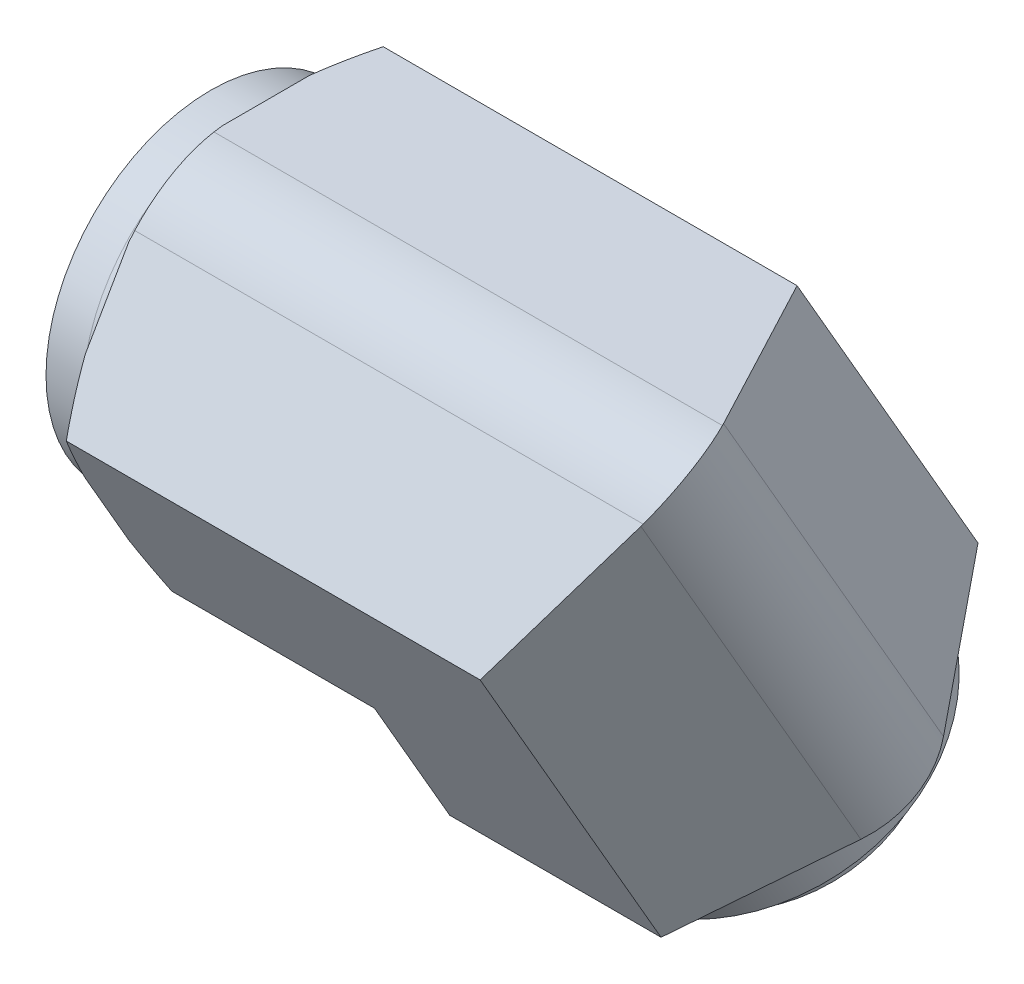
ISO-10303-21;
HEADER;
FILE_DESCRIPTION(('STEP AP214'),'2;1');
FILE_NAME('part.step','',(''),(''),'','','');
FILE_SCHEMA(('AUTOMOTIVE_DESIGN { 1 0 10303 214 1 1 1 1 }'));
ENDSEC;
DATA;
#1=APPLICATION_CONTEXT('core data for automotive mechanical design processes');
#2=APPLICATION_PROTOCOL_DEFINITION('international standard','automotive_design',2000,#1);
#3=PRODUCT_CONTEXT('',#1,'mechanical');
#4=PRODUCT('Part','Part','',(#3));
#5=PRODUCT_RELATED_PRODUCT_CATEGORY('part','',(#4));
#6=PRODUCT_DEFINITION_FORMATION('','',#4);
#7=PRODUCT_DEFINITION_CONTEXT('part definition',#1,'design');
#8=PRODUCT_DEFINITION('design','',#6,#7);
#9=PRODUCT_DEFINITION_SHAPE('','',#8);
#10=(LENGTH_UNIT() NAMED_UNIT(*) SI_UNIT(.MILLI.,.METRE.));
#11=(NAMED_UNIT(*) PLANE_ANGLE_UNIT() SI_UNIT($,.RADIAN.));
#12=(NAMED_UNIT(*) SI_UNIT($,.STERADIAN.) SOLID_ANGLE_UNIT());
#13=UNCERTAINTY_MEASURE_WITH_UNIT(LENGTH_MEASURE(1.E-05),#10,'distance_accuracy_value','');
#14=(GEOMETRIC_REPRESENTATION_CONTEXT(3) GLOBAL_UNCERTAINTY_ASSIGNED_CONTEXT((#13)) GLOBAL_UNIT_ASSIGNED_CONTEXT((#10,
#11,#12)) REPRESENTATION_CONTEXT('',''));
#15=CARTESIAN_POINT('',(0.,0.,0.));
#16=DIRECTION('',(0.,0.,1.));
#17=DIRECTION('',(1.,0.,0.));
#18=AXIS2_PLACEMENT_3D('',#15,#16,#17);
#19=CARTESIAN_POINT('',(17.5,-20.91424694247,-12.07484610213));
#20=DIRECTION('',(0.,0.866025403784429,0.500000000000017));
#21=DIRECTION('',(0.,-0.500000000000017,0.866025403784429));
#22=AXIS2_PLACEMENT_3D('',#19,#20,#21);
#23=PLANE('',#22);
#24=CARTESIAN_POINT('',(17.5,-20.9142469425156,-12.0748461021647));
#25=DIRECTION('',(0.,0.866025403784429,0.500000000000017));
#26=DIRECTION('',(0.,-0.500000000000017,0.866025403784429));
#27=AXIS2_PLACEMENT_3D('',#24,#25,#26);
#28=CIRCLE('',#27,2.0977720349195);
#29=CARTESIAN_POINT('',(17.5,-21.9631329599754,-10.2581222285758));
#30=VERTEX_POINT('',#29);
#31=EDGE_CURVE('E241',#30,#30,#28,.T.);
#32=ORIENTED_EDGE('',*,*,#31,.T.);
#33=EDGE_LOOP('',(#32));
#34=FACE_BOUND('',#33,.T.);
#35=CARTESIAN_POINT('',(17.5,-20.9142469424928,-12.0748461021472));
#36=DIRECTION('',(0.,0.866025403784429,0.500000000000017));
#37=DIRECTION('',(0.,-0.500000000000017,0.866025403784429));
#38=AXIS2_PLACEMENT_3D('',#35,#36,#37);
#39=CIRCLE('',#38,3.43001634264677);
#40=CARTESIAN_POINT('',(17.5,-22.6292551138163,-9.10436481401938));
#41=VERTEX_POINT('',#40);
#42=EDGE_CURVE('E891',#41,#41,#39,.T.);
#43=ORIENTED_EDGE('',*,*,#42,.F.);
#44=EDGE_LOOP('',(#43));
#45=FACE_BOUND('',#44,.T.);
#46=ADVANCED_FACE('F16',(#34,#45),#23,.F.);
#47=CARTESIAN_POINT('',(17.5,-17.2115780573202,-9.93710922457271));
#48=DIRECTION('',(0.,0.866025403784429,0.500000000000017));
#49=DIRECTION('',(0.,-0.500000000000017,0.866025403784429));
#50=AXIS2_PLACEMENT_3D('',#47,#48,#49);
#51=CONICAL_SURFACE('',#50,6.93450302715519,0.686621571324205);
#52=CARTESIAN_POINT('',(17.5,-17.2115780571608,-9.93710922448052));
#53=DIRECTION('',(0.,0.866025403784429,0.500000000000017));
#54=DIRECTION('',(0.,-0.500000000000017,0.866025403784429));
#55=AXIS2_PLACEMENT_3D('',#52,#53,#54);
#56=CIRCLE('',#55,6.934503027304);
#57=CARTESIAN_POINT('',(17.5,-20.678829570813,-3.93165344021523));
#58=VERTEX_POINT('',#57);
#59=EDGE_CURVE('E238',#58,#58,#56,.T.);
#60=ORIENTED_EDGE('',*,*,#59,.F.);
#61=EDGE_LOOP('',(#60));
#62=FACE_BOUND('',#61,.T.);
#63=ORIENTED_EDGE('',*,*,#42,.T.);
#64=EDGE_LOOP('',(#63));
#65=FACE_BOUND('',#64,.T.);
#66=ADVANCED_FACE('F970',(#62,#65),#51,.T.);
#67=CARTESIAN_POINT('',(17.5,-14.7224318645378,-8.50000000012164));
#68=DIRECTION('',(0.,0.866025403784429,0.500000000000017));
#69=DIRECTION('',(0.,-0.500000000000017,0.866025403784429));
#70=AXIS2_PLACEMENT_3D('',#67,#68,#69);
#71=CONICAL_SURFACE('',#70,3.35992660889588,0.174732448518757);
#72=CARTESIAN_POINT('',(17.5,-14.7224318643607,-8.50000000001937));
#73=DIRECTION('',(0.,0.866025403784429,0.500000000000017));
#74=DIRECTION('',(0.,-0.500000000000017,0.866025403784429));
#75=AXIS2_PLACEMENT_3D('',#72,#73,#74);
#76=CIRCLE('',#75,3.35992660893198);
#77=CARTESIAN_POINT('',(17.5,-16.4023951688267,-5.590218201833));
#78=VERTEX_POINT('',#77);
#79=EDGE_CURVE('E215',#78,#78,#76,.F.);
#80=ORIENTED_EDGE('',*,*,#79,.F.);
#81=EDGE_LOOP('',(#80));
#82=FACE_BOUND('',#81,.T.);
#83=ORIENTED_EDGE('',*,*,#31,.F.);
#84=EDGE_LOOP('',(#83));
#85=FACE_BOUND('',#84,.T.);
#86=ADVANCED_FACE('F967',(#82,#85),#71,.F.);
#87=CARTESIAN_POINT('',(17.5,0.,0.));
#88=DIRECTION('',(0.,0.866025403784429,0.500000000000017));
#89=DIRECTION('',(0.,-0.500000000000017,0.866025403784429));
#90=AXIS2_PLACEMENT_3D('',#87,#88,#89);
#91=CYLINDRICAL_SURFACE('',#90,6.934503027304);
#92=CARTESIAN_POINT('',(17.5,-15.8761892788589,-9.16612215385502));
#93=DIRECTION('',(0.,0.866025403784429,0.500000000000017));
#94=DIRECTION('',(0.,-0.500000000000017,0.866025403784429));
#95=AXIS2_PLACEMENT_3D('',#92,#93,#94);
#96=CIRCLE('',#95,6.934503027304);
#97=CARTESIAN_POINT('',(17.5,-19.343440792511,-3.16066636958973));
#98=VERTEX_POINT('',#97);
#99=EDGE_CURVE('E214',#98,#98,#96,.T.);
#100=ORIENTED_EDGE('',*,*,#99,.F.);
#101=EDGE_LOOP('',(#100));
#102=FACE_BOUND('',#101,.T.);
#103=ORIENTED_EDGE('',*,*,#59,.T.);
#104=EDGE_LOOP('',(#103));
#105=FACE_BOUND('',#104,.T.);
#106=ADVANCED_FACE('F963',(#102,#105),#91,.T.);
#107=CARTESIAN_POINT('',(17.5,-14.72243186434,-8.5));
#108=DIRECTION('',(0.,0.866025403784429,0.500000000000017));
#109=DIRECTION('',(0.,-0.500000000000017,0.866025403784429));
#110=AXIS2_PLACEMENT_3D('',#107,#108,#109);
#111=PLANE('',#110);
#112=ORIENTED_EDGE('',*,*,#79,.T.);
#113=EDGE_LOOP('',(#112));
#114=FACE_BOUND('',#113,.T.);
#115=CARTESIAN_POINT('',(17.5,-14.722431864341,-8.5000000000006));
#116=DIRECTION('',(0.,0.866025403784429,0.500000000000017));
#117=DIRECTION('',(0.,-0.500000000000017,0.866025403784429));
#118=AXIS2_PLACEMENT_3D('',#115,#116,#117);
#119=CIRCLE('',#118,4.);
#120=CARTESIAN_POINT('',(17.5,-16.7224318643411,-5.03589838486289));
#121=VERTEX_POINT('',#120);
#122=EDGE_CURVE('E231',#121,#121,#119,.T.);
#123=ORIENTED_EDGE('',*,*,#122,.T.);
#124=EDGE_LOOP('',(#123));
#125=FACE_BOUND('',#124,.T.);
#126=ADVANCED_FACE('F960',(#114,#125),#111,.T.);
#127=CARTESIAN_POINT('',(17.5,0.,0.));
#128=DIRECTION('',(1.,0.,0.));
#129=DIRECTION('',(0.,0.,-1.));
#130=AXIS2_PLACEMENT_3D('',#127,#128,#129);
#131=CYLINDRICAL_SURFACE('',#130,4.);
#132=DIRECTION('',(1.,0.,0.));
#133=VECTOR('',#132,1.);
#134=CARTESIAN_POINT('',(17.5,-3.46410161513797,2.));
#135=LINE('',#134,#133);
#136=CARTESIAN_POINT('',(19.5000000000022,-3.46410161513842,2.00000000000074));
#137=VERTEX_POINT('',#136);
#138=CARTESIAN_POINT('',(17.5,-3.46410161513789,1.99999999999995));
#139=VERTEX_POINT('',#138);
#140=EDGE_CURVE('E210',#137,#139,#135,.F.);
#141=ORIENTED_EDGE('',*,*,#140,.T.);
#142=CARTESIAN_POINT('',(17.5,0.,0.));
#143=DIRECTION('',(1.,0.,0.));
#144=DIRECTION('',(0.,0.,-1.));
#145=AXIS2_PLACEMENT_3D('',#142,#143,#144);
#146=CIRCLE('',#145,4.);
#147=CARTESIAN_POINT('',(17.5,0.,-4.));
#148=VERTEX_POINT('',#147);
#149=EDGE_CURVE('E225',#139,#148,#146,.T.);
#150=ORIENTED_EDGE('',*,*,#149,.T.);
#151=DIRECTION('',(1.,0.,0.));
#152=VECTOR('',#151,1.);
#153=CARTESIAN_POINT('',(17.5,0.,-4.));
#154=LINE('',#153,#152);
#155=CARTESIAN_POINT('',(19.4999999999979,-6.3501721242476E-13,-3.9999999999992));
#156=VERTEX_POINT('',#155);
#157=EDGE_CURVE('E212',#148,#156,#154,.T.);
#158=ORIENTED_EDGE('',*,*,#157,.T.);
#159=CARTESIAN_POINT('',(17.5,-6.49653941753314E-13,1.12583553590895E-12));
#160=DIRECTION('',(0.707106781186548,0.612372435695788,0.353553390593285));
#161=DIRECTION('',(0.707106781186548,-0.612372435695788,-0.353553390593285));
#162=AXIS2_PLACEMENT_3D('',#159,#160,#161);
#163=ELLIPSE('',#162,5.65685424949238,4.);
#164=EDGE_CURVE('E205',#156,#137,#163,.F.);
#165=ORIENTED_EDGE('',*,*,#164,.T.);
#166=EDGE_LOOP('',(#141,#150,#158,#165));
#167=FACE_BOUND('',#166,.T.);
#168=ADVANCED_FACE('F207',(#167),#131,.T.);
#169=CARTESIAN_POINT('',(17.5,-15.87618927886,-9.166122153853));
#170=DIRECTION('',(0.,0.866025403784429,0.500000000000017));
#171=DIRECTION('',(0.,-0.500000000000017,0.866025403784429));
#172=AXIS2_PLACEMENT_3D('',#169,#170,#171);
#173=PLANE('',#172);
#174=CARTESIAN_POINT('',(17.5,-15.8761892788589,-9.16612215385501));
#175=DIRECTION('',(0.,0.866025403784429,0.500000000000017));
#176=DIRECTION('',(0.,-0.500000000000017,0.866025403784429));
#177=AXIS2_PLACEMENT_3D('',#174,#175,#176);
#178=CIRCLE('',#177,4.551452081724);
#179=CARTESIAN_POINT('',(17.5,-18.1519153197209,-5.2244490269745));
#180=VERTEX_POINT('',#179);
#181=EDGE_CURVE('E903',#180,#180,#178,.T.);
#182=ORIENTED_EDGE('',*,*,#181,.F.);
#183=EDGE_LOOP('',(#182));
#184=FACE_BOUND('',#183,.T.);
#185=ORIENTED_EDGE('',*,*,#99,.T.);
#186=EDGE_LOOP('',(#185));
#187=FACE_BOUND('',#186,.T.);
#188=ADVANCED_FACE('F954',(#184,#187),#173,.T.);
#189=CARTESIAN_POINT('',(17.5,-1.732050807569,-1.));
#190=DIRECTION('',(0.,0.866025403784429,0.500000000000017));
#191=DIRECTION('',(0.,-0.500000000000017,0.866025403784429));
#192=AXIS2_PLACEMENT_3D('',#189,#190,#191);
#193=PLANE('',#192);
#194=CARTESIAN_POINT('',(17.5,-1.73205080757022,-0.999999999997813));
#195=DIRECTION('',(0.,0.866025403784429,0.500000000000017));
#196=DIRECTION('',(0.,-0.500000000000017,0.866025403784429));
#197=AXIS2_PLACEMENT_3D('',#194,#195,#196);
#198=CIRCLE('',#197,4.);
#199=CARTESIAN_POINT('',(15.5000000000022,-4.83662589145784E-13,-3.99999999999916));
#200=VERTEX_POINT('',#199);
#201=EDGE_CURVE('E200',#200,#156,#198,.F.);
#202=ORIENTED_EDGE('',*,*,#201,.T.);
#203=ORIENTED_EDGE('',*,*,#157,.F.);
#204=DIRECTION('',(1.,0.,0.));
#205=VECTOR('',#204,1.);
#206=CARTESIAN_POINT('',(0.,0.,-4.));
#207=LINE('',#206,#205);
#208=EDGE_CURVE('E235',#148,#200,#207,.F.);
#209=ORIENTED_EDGE('',*,*,#208,.T.);
#210=EDGE_LOOP('',(#202,#203,#209));
#211=FACE_BOUND('',#210,.T.);
#212=ADVANCED_FACE('F951',(#211),#193,.F.);
#213=CARTESIAN_POINT('',(17.5,-14.72243186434,-8.5));
#214=DIRECTION('',(0.,0.866025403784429,0.500000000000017));
#215=DIRECTION('',(0.,-0.500000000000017,0.866025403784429));
#216=AXIS2_PLACEMENT_3D('',#213,#214,#215);
#217=CYLINDRICAL_SURFACE('',#216,4.);
#218=CARTESIAN_POINT('',(17.5,-6.49653941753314E-13,1.12583553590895E-12));
#219=DIRECTION('',(-0.707106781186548,0.612372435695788,0.353553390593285));
#220=DIRECTION('',(0.707106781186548,0.612372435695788,0.353553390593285));
#221=AXIS2_PLACEMENT_3D('',#218,#219,#220);
#222=ELLIPSE('',#221,5.65685424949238,4.);
#223=CARTESIAN_POINT('',(15.4999999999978,-3.46410161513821,2.00000000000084));
#224=VERTEX_POINT('',#223);
#225=EDGE_CURVE('E222',#200,#224,#222,.T.);
#226=ORIENTED_EDGE('',*,*,#225,.T.);
#227=CARTESIAN_POINT('',(17.5,-1.73205080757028,-0.999999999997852));
#228=DIRECTION('',(0.,0.866025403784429,0.500000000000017));
#229=DIRECTION('',(0.,-0.500000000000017,0.866025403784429));
#230=AXIS2_PLACEMENT_3D('',#227,#228,#229);
#231=CIRCLE('',#230,4.);
#232=EDGE_CURVE('E218',#224,#137,#231,.T.);
#233=ORIENTED_EDGE('',*,*,#232,.T.);
#234=ORIENTED_EDGE('',*,*,#164,.F.);
#235=ORIENTED_EDGE('',*,*,#201,.F.);
#236=EDGE_LOOP('',(#226,#233,#234,#235));
#237=FACE_BOUND('',#236,.T.);
#238=ORIENTED_EDGE('',*,*,#122,.F.);
#239=EDGE_LOOP('',(#238));
#240=FACE_BOUND('',#239,.T.);
#241=ADVANCED_FACE('F219',(#237,#240),#217,.F.);
#242=CARTESIAN_POINT('',(17.5,-1.732050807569,-1.));
#243=DIRECTION('',(0.,0.866025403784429,0.500000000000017));
#244=DIRECTION('',(0.,-0.500000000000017,0.866025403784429));
#245=AXIS2_PLACEMENT_3D('',#242,#243,#244);
#246=PLANE('',#245);
#247=ORIENTED_EDGE('',*,*,#232,.F.);
#248=DIRECTION('',(1.,0.,0.));
#249=VECTOR('',#248,1.);
#250=CARTESIAN_POINT('',(0.,-3.46410161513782,1.9999999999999));
#251=LINE('',#250,#249);
#252=EDGE_CURVE('E228',#224,#139,#251,.T.);
#253=ORIENTED_EDGE('',*,*,#252,.T.);
#254=ORIENTED_EDGE('',*,*,#140,.F.);
#255=EDGE_LOOP('',(#247,#253,#254));
#256=FACE_BOUND('',#255,.T.);
#257=ADVANCED_FACE('F227',(#256),#246,.F.);
#258=CARTESIAN_POINT('',(17.5,0.,0.));
#259=DIRECTION('',(1.,0.,0.));
#260=DIRECTION('',(0.,0.,-1.));
#261=AXIS2_PLACEMENT_3D('',#258,#259,#260);
#262=PLANE('',#261);
#263=CARTESIAN_POINT('',(17.5,0.,0.));
#264=DIRECTION('',(1.,0.,0.));
#265=DIRECTION('',(0.,0.,-1.));
#266=AXIS2_PLACEMENT_3D('',#263,#264,#265);
#267=CIRCLE('',#266,4.);
#268=EDGE_CURVE('E907',#139,#148,#267,.F.);
#269=ORIENTED_EDGE('',*,*,#268,.T.);
#270=ORIENTED_EDGE('',*,*,#149,.F.);
#271=EDGE_LOOP('',(#269,#270));
#272=FACE_BOUND('',#271,.T.);
#273=ADVANCED_FACE('F942',(#272),#262,.F.);
#274=CARTESIAN_POINT('',(17.5,0.,0.));
#275=DIRECTION('',(0.,0.866025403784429,0.500000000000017));
#276=DIRECTION('',(0.,-0.500000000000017,0.866025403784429));
#277=AXIS2_PLACEMENT_3D('',#274,#275,#276);
#278=CYLINDRICAL_SURFACE('',#277,4.551452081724);
#279=ORIENTED_EDGE('',*,*,#181,.T.);
#280=EDGE_LOOP('',(#279));
#281=FACE_BOUND('',#280,.T.);
#282=CARTESIAN_POINT('',(17.5,-14.7224318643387,-8.50000000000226));
#283=DIRECTION('',(0.,0.866025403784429,0.500000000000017));
#284=DIRECTION('',(0.,-0.500000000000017,0.866025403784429));
#285=AXIS2_PLACEMENT_3D('',#282,#283,#284);
#286=CIRCLE('',#285,4.551452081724);
#287=CARTESIAN_POINT('',(17.5,-16.9981579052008,-4.55832687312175));
#288=VERTEX_POINT('',#287);
#289=EDGE_CURVE('E909',#288,#288,#286,.T.);
#290=ORIENTED_EDGE('',*,*,#289,.F.);
#291=EDGE_LOOP('',(#290));
#292=FACE_BOUND('',#291,.T.);
#293=ADVANCED_FACE('F936',(#281,#292),#278,.T.);
#294=CARTESIAN_POINT('',(0.,0.,0.));
#295=DIRECTION('',(1.,0.,0.));
#296=DIRECTION('',(0.,0.,-1.));
#297=AXIS2_PLACEMENT_3D('',#294,#295,#296);
#298=CYLINDRICAL_SURFACE('',#297,4.);
#299=CARTESIAN_POINT('',(-3.,0.,0.));
#300=DIRECTION('',(1.,0.,0.));
#301=DIRECTION('',(0.,0.,-1.));
#302=AXIS2_PLACEMENT_3D('',#299,#300,#301);
#303=CIRCLE('',#302,4.);
#304=CARTESIAN_POINT('',(-3.,0.,-4.));
#305=VERTEX_POINT('',#304);
#306=EDGE_CURVE('E912',#305,#305,#303,.T.);
#307=ORIENTED_EDGE('',*,*,#306,.F.);
#308=EDGE_LOOP('',(#307));
#309=FACE_BOUND('',#308,.T.);
#310=ORIENTED_EDGE('',*,*,#252,.F.);
#311=ORIENTED_EDGE('',*,*,#225,.F.);
#312=ORIENTED_EDGE('',*,*,#208,.F.);
#313=ORIENTED_EDGE('',*,*,#268,.F.);
#314=EDGE_LOOP('',(#310,#311,#312,#313));
#315=FACE_BOUND('',#314,.T.);
#316=ADVANCED_FACE('F925',(#309,#315),#298,.F.);
#317=CARTESIAN_POINT('',(0.,-14.72243186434,-8.5));
#318=DIRECTION('',(0.,-0.866025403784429,-0.500000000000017));
#319=DIRECTION('',(0.,0.500000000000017,-0.866025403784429));
#320=AXIS2_PLACEMENT_3D('',#317,#318,#319);
#321=PLANE('',#320);
#322=ORIENTED_EDGE('',*,*,#289,.T.);
#323=EDGE_LOOP('',(#322));
#324=FACE_BOUND('',#323,.T.);
#325=CARTESIAN_POINT('',(17.5,-14.7224318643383,-8.50000000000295));
#326=DIRECTION('',(0.,-0.866025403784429,-0.500000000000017));
#327=DIRECTION('',(0.,0.500000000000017,-0.866025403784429));
#328=AXIS2_PLACEMENT_3D('',#325,#326,#327);
#329=CIRCLE('',#328,9.);
#330=CARTESIAN_POINT('',(17.5,-10.2224318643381,-16.2942286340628));
#331=VERTEX_POINT('',#330);
#332=EDGE_CURVE('E822',#331,#331,#329,.F.);
#333=ORIENTED_EDGE('',*,*,#332,.F.);
#334=EDGE_LOOP('',(#333));
#335=FACE_BOUND('',#334,.T.);
#336=ADVANCED_FACE('F922',(#324,#335),#321,.T.);
#337=CARTESIAN_POINT('',(-3.,0.,0.));
#338=DIRECTION('',(-1.,0.,0.));
#339=DIRECTION('',(0.,0.,1.));
#340=AXIS2_PLACEMENT_3D('',#337,#338,#339);
#341=PLANE('',#340);
#342=ORIENTED_EDGE('',*,*,#306,.T.);
#343=EDGE_LOOP('',(#342));
#344=FACE_BOUND('',#343,.T.);
#345=CARTESIAN_POINT('',(-3.,0.,0.));
#346=DIRECTION('',(-1.,0.,0.));
#347=DIRECTION('',(0.,0.,1.));
#348=AXIS2_PLACEMENT_3D('',#345,#346,#347);
#349=CIRCLE('',#348,9.);
#350=CARTESIAN_POINT('',(-3.,0.,9.));
#351=VERTEX_POINT('',#350);
#352=EDGE_CURVE('E627',#351,#351,#349,.F.);
#353=ORIENTED_EDGE('',*,*,#352,.F.);
#354=EDGE_LOOP('',(#353));
#355=FACE_BOUND('',#354,.T.);
#356=ADVANCED_FACE('F924',(#344,#355),#341,.T.);
#357=CARTESIAN_POINT('',(0.659133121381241,0.,0.));
#358=DIRECTION('',(1.,0.,0.));
#359=DIRECTION('',(0.,0.,-1.));
#360=AXIS2_PLACEMENT_3D('',#357,#358,#359);
#361=CONICAL_SURFACE('',#360,11.554612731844,1.09382682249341);
#362=CARTESIAN_POINT('',(-1.03883531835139E-12,2.93962646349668,9.84981125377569));
#363=CARTESIAN_POINT('',(0.0342428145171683,2.69152866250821,9.99305058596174));
#364=CARTESIAN_POINT('',(0.0742996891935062,2.44406792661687,10.1359221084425));
#365=CARTESIAN_POINT('',(0.164924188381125,1.95087327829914,10.4206681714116));
#366=CARTESIAN_POINT('',(0.215479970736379,1.70513774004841,10.5625436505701));
#367=CARTESIAN_POINT('',(0.326055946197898,1.21533566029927,10.845331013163));
#368=CARTESIAN_POINT('',(0.386074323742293,0.971268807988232,10.986243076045));
#369=CARTESIAN_POINT('',(0.514569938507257,0.484517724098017,11.2672689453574));
#370=CARTESIAN_POINT('',(0.583056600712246,0.241835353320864,11.4073816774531));
#371=CARTESIAN_POINT('',(0.65520190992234,8.96216786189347E-13,11.547005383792));
#372=B_SPLINE_CURVE_WITH_KNOTS('',3,(#362,#363,#364,#365,#366,#367,#368,#369,#370,#371),
.UNSPECIFIED.,.F.,.F.,(4,2,2,2,4),(0.,0.865436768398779,1.7299026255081,2.59420282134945,
3.45947376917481),.UNSPECIFIED.);
#373=CARTESIAN_POINT('',(-8.49878038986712E-13,2.93962646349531,9.84981125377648));
#374=VERTEX_POINT('',#373);
#375=CARTESIAN_POINT('',(0.655201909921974,9.52898129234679E-13,11.5470053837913));
#376=VERTEX_POINT('',#375);
#377=EDGE_CURVE('E614',#374,#376,#372,.T.);
#378=ORIENTED_EDGE('',*,*,#377,.F.);
#379=CARTESIAN_POINT('',(-6.60604383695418E-13,0.,0.));
#380=DIRECTION('',(1.,0.,0.));
#381=DIRECTION('',(0.,0.,-1.));
#382=AXIS2_PLACEMENT_3D('',#379,#380,#381);
#383=CIRCLE('',#382,10.2791140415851);
#384=CARTESIAN_POINT('',(-3.30302191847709E-13,-2.93962646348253,9.84981125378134));
#385=VERTEX_POINT('',#384);
#386=EDGE_CURVE('E915',#374,#385,#383,.T.);
#387=ORIENTED_EDGE('',*,*,#386,.T.);
#388=CARTESIAN_POINT('',(0.655201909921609,1.01013273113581E-12,11.5470053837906));
#389=CARTESIAN_POINT('',(0.583056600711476,-0.241835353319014,11.4073816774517));
#390=CARTESIAN_POINT('',(0.51456993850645,-0.484517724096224,11.2672689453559));
#391=CARTESIAN_POINT('',(0.386074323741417,-0.971268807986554,10.9862430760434));
#392=CARTESIAN_POINT('',(0.32605594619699,-1.21533566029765,10.8453310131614));
#393=CARTESIAN_POINT('',(0.215479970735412,-1.70513774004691,10.5625436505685));
#394=CARTESIAN_POINT('',(0.16492418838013,-1.9508732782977,10.4206681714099));
#395=CARTESIAN_POINT('',(0.0742996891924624,-2.44406792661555,10.1359221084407));
#396=CARTESIAN_POINT('',(0.0342428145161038,-2.69152866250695,9.99305058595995));
#397=CARTESIAN_POINT('',(-2.11878079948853E-12,-2.93962646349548,9.84981125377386));
#398=B_SPLINE_CURVE_WITH_KNOTS('',3,(#388,#389,#390,#391,#392,#393,#394,#395,#396,#397),
.UNSPECIFIED.,.F.,.F.,(4,2,2,2,4),(0.,0.865270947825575,1.72957114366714,2.59403700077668,
3.45947376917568),.UNSPECIFIED.);
#399=EDGE_CURVE('E587',#376,#385,#398,.T.);
#400=ORIENTED_EDGE('',*,*,#399,.F.);
#401=EDGE_LOOP('',(#378,#387,#400));
#402=FACE_BOUND('',#401,.T.);
#403=ADVANCED_FACE('F933',(#402),#361,.T.);
#404=CARTESIAN_POINT('',(0.,0.,0.));
#405=DIRECTION('',(1.,0.,0.));
#406=DIRECTION('',(0.,0.,-1.));
#407=AXIS2_PLACEMENT_3D('',#404,#405,#406);
#408=PLANE('',#407);
#409=DIRECTION('',(0.,-0.866025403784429,0.500000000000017));
#410=VECTOR('',#409,1.);
#411=CARTESIAN_POINT('',(0.,10.,5.773502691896));
#412=LINE('',#411,#410);
#413=CARTESIAN_POINT('',(0.,4.99998921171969,8.6602602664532));
#414=VERTEX_POINT('',#413);
#415=EDGE_CURVE('E625',#414,#374,#412,.T.);
#416=ORIENTED_EDGE('',*,*,#415,.F.);
#417=CARTESIAN_POINT('',(0.,-4.999999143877,8.66025453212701));
#418=CARTESIAN_POINT('',(1.45429110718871E-09,-4.90713369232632,8.71384983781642));
#419=CARTESIAN_POINT('',(8.54202775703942E-10,-4.81341542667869,8.76596929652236));
#420=CARTESIAN_POINT('',(-8.61739862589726E-10,-4.62436105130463,8.86718570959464));
#421=CARTESIAN_POINT('',(-1.97759321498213E-09,-4.52902494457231,8.91628266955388));
#422=CARTESIAN_POINT('',(-1.13209455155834E-09,-4.3368219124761,9.0113836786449));
#423=CARTESIAN_POINT('',(8.29270731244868E-10,-4.23995498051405,9.05738771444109));
#424=CARTESIAN_POINT('',(-2.60747661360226E-08,-4.07828409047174,9.13110460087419));
#425=CARTESIAN_POINT('',(-4.46021771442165E-08,-4.01387319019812,9.15968117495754));
#426=CARTESIAN_POINT('',(-4.11895617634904E-08,-3.94586055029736,9.18890297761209));
#427=CARTESIAN_POINT('',(-4.09694749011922E-08,-3.94258435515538,9.19030829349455));
#428=CARTESIAN_POINT('',(-3.76934893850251E-08,-3.89374708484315,9.21122598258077));
#429=CARTESIAN_POINT('',(-3.46895856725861E-08,-3.84804107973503,9.23040131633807));
#430=CARTESIAN_POINT('',(-2.57347060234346E-08,-3.70239494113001,9.29023561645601));
#431=CARTESIAN_POINT('',(-2.04757458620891E-08,-3.60193035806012,9.32962054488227));
#432=CARTESIAN_POINT('',(-9.36554146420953E-09,-3.34512938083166,9.42552780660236));
#433=CARTESIAN_POINT('',(-4.73067070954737E-09,-3.18794556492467,9.47980623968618));
#434=CARTESIAN_POINT('',(-1.231207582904E-09,-2.96825248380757,9.54958863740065));
#435=CARTESIAN_POINT('',(-5.71057218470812E-10,-2.90679292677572,9.56845941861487));
#436=CARTESIAN_POINT('',(1.13702460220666E-10,-2.77251182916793,9.60828024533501));
#437=CARTESIAN_POINT('',(3.73919563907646E-12,-2.69962156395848,9.62899966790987));
#438=CARTESIAN_POINT('',(-3.7197147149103E-10,-2.51988078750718,9.67790171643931));
#439=CARTESIAN_POINT('',(-6.86017656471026E-10,-2.41277577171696,9.70515295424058));
#440=CARTESIAN_POINT('',(-4.42525147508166E-10,-2.19772591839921,9.75610565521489));
#441=CARTESIAN_POINT('',(1.150118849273E-10,-2.08978108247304,9.77980712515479));
#442=CARTESIAN_POINT('',(-1.1505127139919E-10,-1.87316806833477,9.82363690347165));
#443=CARTESIAN_POINT('',(-9.02655613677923E-10,-1.76449988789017,9.84376520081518));
#444=CARTESIAN_POINT('',(-5.9704281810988E-09,-1.5465559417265,9.88042151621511));
#445=CARTESIAN_POINT('',(-1.02506246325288E-08,-1.43728017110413,9.89694950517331));
#446=CARTESIAN_POINT('',(-3.36842322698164E-08,-1.24015019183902,9.92346060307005));
#447=CARTESIAN_POINT('',(-4.96921615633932E-08,-1.15238220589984,9.9340915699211));
#448=CARTESIAN_POINT('',(-8.55699784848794E-08,-0.932032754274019,9.9577828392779));
#449=CARTESIAN_POINT('',(-1.03284499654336E-07,-0.799286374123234,9.9693431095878));
#450=CARTESIAN_POINT('',(-7.98651462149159E-08,-0.555593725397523,9.98558023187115));
#451=CARTESIAN_POINT('',(-4.80479689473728E-08,-0.44470180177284,9.99108324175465));
#452=CARTESIAN_POINT('',(-1.17975273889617E-08,-0.273520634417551,9.99658728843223));
#453=CARTESIAN_POINT('',(-1.4950513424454E-09,-0.213273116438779,9.99795349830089));
#454=CARTESIAN_POINT('',(2.63423225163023E-10,-0.138919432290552,9.99904871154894));
#455=CARTESIAN_POINT('',(1.10741320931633E-10,-0.124818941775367,9.99923018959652));
#456=CARTESIAN_POINT('',(-6.9074516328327E-10,-0.0286352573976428,10.0002751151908));
#457=CARTESIAN_POINT('',(-1.82586116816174E-10,0.0534591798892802,10.000208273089));
#458=CARTESIAN_POINT('',(-2.59925721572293E-09,0.28795122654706,9.99711856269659));
#459=CARTESIAN_POINT('',(-8.83800437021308E-09,0.440326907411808,9.99161237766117));
#460=CARTESIAN_POINT('',(-2.64478162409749E-08,0.648851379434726,9.97931797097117));
#461=CARTESIAN_POINT('',(-3.21158475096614E-08,0.705192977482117,9.97551873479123));
#462=CARTESIAN_POINT('',(-4.61223859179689E-08,0.838933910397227,9.9653564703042));
#463=CARTESIAN_POINT('',(-5.4664858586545E-08,0.91630154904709,9.95856635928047));
#464=CARTESIAN_POINT('',(-6.97720180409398E-08,1.10301989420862,9.93996648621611));
#465=CARTESIAN_POINT('',(-7.40338863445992E-08,1.21228044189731,9.9272437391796));
#466=CARTESIAN_POINT('',(-7.22587341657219E-08,1.43177485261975,9.89798193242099));
#467=CARTESIAN_POINT('',(-6.60833989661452E-08,1.54200222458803,9.88139417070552));
#468=CARTESIAN_POINT('',(-4.90329959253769E-08,1.7313166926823,9.84963441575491));
#469=CARTESIAN_POINT('',(-3.99387178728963E-08,1.81055304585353,9.83534793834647));
#470=CARTESIAN_POINT('',(-2.77171545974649E-08,1.92859972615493,9.81258376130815));
#471=CARTESIAN_POINT('',(-2.39012309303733E-08,1.96755128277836,9.8048305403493));
#472=CARTESIAN_POINT('',(-1.02972028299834E-08,2.13098470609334,9.77129040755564));
#473=CARTESIAN_POINT('',(-5.84818410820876E-09,2.25503777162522,9.74336806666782));
#474=CARTESIAN_POINT('',(-1.44455115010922E-09,2.48404616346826,9.68723315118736));
#475=CARTESIAN_POINT('',(-9.30872953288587E-10,2.58915760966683,9.65965212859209));
#476=CARTESIAN_POINT('',(-8.46659193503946E-10,2.79160600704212,9.60302679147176));
#477=CARTESIAN_POINT('',(-1.21673535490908E-09,2.88900248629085,9.57419558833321));
#478=CARTESIAN_POINT('',(-6.85134469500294E-09,3.07358582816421,9.51650461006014));
#479=CARTESIAN_POINT('',(-1.16433491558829E-08,3.16085648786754,9.48791244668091));
#480=CARTESIAN_POINT('',(-2.16441548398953E-08,3.34904959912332,9.42335308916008));
#481=CARTESIAN_POINT('',(-2.67893165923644E-08,3.44982323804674,9.38695093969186));
#482=CARTESIAN_POINT('',(-3.46400474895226E-08,3.65014448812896,9.31091756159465));
#483=CARTESIAN_POINT('',(-3.73456061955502E-08,3.74969209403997,9.2712863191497));
#484=CARTESIAN_POINT('',(-3.90183899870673E-08,3.94745721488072,9.1888328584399));
#485=CARTESIAN_POINT('',(-3.7985613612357E-08,4.04567472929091,9.14601063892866));
#486=CARTESIAN_POINT('',(-3.26645016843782E-08,4.24067711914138,9.05722087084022));
#487=CARTESIAN_POINT('',(-2.83761775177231E-08,4.33746199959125,9.01125333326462));
#488=CARTESIAN_POINT('',(-1.83796986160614E-08,4.5294979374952,8.91622055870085));
#489=CARTESIAN_POINT('',(-1.2671554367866E-08,4.6247490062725,8.86715534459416));
#490=CARTESIAN_POINT('',(-3.61808917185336E-09,4.81361820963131,8.76597922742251));
#491=CARTESIAN_POINT('',(-2.72741586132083E-10,4.90723636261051,8.71386835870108));
#492=CARTESIAN_POINT('',(0.,4.99998921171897,8.66026026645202));
#493=B_SPLINE_CURVE_WITH_KNOTS('',3,(#417,#418,#419,#420,#421,#422,#423,#424,#425,#426,#427,
#428,#429,#430,#431,#432,#433,#434,#435,#436,#437,#438,#439,#440,#441,#442,#443,#444,#445,#446,
#447,#448,#449,#450,#451,#452,#453,#454,#455,#456,#457,#458,#459,#460,#461,#462,#463,#464,#465,
#466,#467,#468,#469,#470,#471,#472,#473,#474,#475,#476,#477,#478,#479,#480,#481,#482,#483,#484,
#485,#486,#487,#488,#489,#490,#491,#492),.UNSPECIFIED.,.F.,.F.,(4,2,2,2,2,2,2,2,2,2,2,2,2,2,2,2,
2,2,2,2,2,2,2,2,2,2,2,2,2,2,2,2,2,2,2,2,2,4),(0.,0.321652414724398,0.643304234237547,
0.964957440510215,1.17633637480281,1.18703101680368,1.33572156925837,1.65939655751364,
2.1580273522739,2.35089373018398,2.57820770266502,2.90969749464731,3.24118665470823,
3.57267683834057,3.90416970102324,4.16937136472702,4.56899933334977,4.90201734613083,
5.08279704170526,5.12510200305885,5.3713649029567,5.82859662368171,5.99800063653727,
6.23097356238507,6.56090766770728,6.89524845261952,7.13676546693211,7.25591120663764,
7.63727460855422,7.96323125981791,8.26790612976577,8.54337821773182,8.86476100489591,
9.18614516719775,9.50752945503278,9.82891261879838,10.1502934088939,10.4716705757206),.UNSPECIFIED.);
#494=CARTESIAN_POINT('',(0.,-4.99999914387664,8.66025453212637));
#495=VERTEX_POINT('',#494);
#496=EDGE_CURVE('E633',#414,#495,#493,.F.);
#497=ORIENTED_EDGE('',*,*,#496,.T.);
#498=DIRECTION('',(0.,-0.866025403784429,-0.500000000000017));
#499=VECTOR('',#498,1.);
#500=CARTESIAN_POINT('',(0.,0.,11.54700538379));
#501=LINE('',#500,#499);
#502=EDGE_CURVE('E1314',#385,#495,#501,.T.);
#503=ORIENTED_EDGE('',*,*,#502,.F.);
#504=ORIENTED_EDGE('',*,*,#386,.F.);
#505=EDGE_LOOP('',(#416,#497,#503,#504));
#506=FACE_BOUND('',#505,.T.);
#507=ADVANCED_FACE('F1081',(#506),#408,.F.);
#508=CARTESIAN_POINT('',(0.,0.,0.));
#509=DIRECTION('',(1.,0.,0.));
#510=DIRECTION('',(0.,0.,-1.));
#511=AXIS2_PLACEMENT_3D('',#508,#509,#510);
#512=PLANE('',#511);
#513=CARTESIAN_POINT('',(-8.83950031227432E-13,0.,0.));
#514=DIRECTION('',(1.,0.,0.));
#515=DIRECTION('',(0.,1.,0.));
#516=AXIS2_PLACEMENT_3D('',#513,#514,#515);
#517=CIRCLE('',#516,10.2791140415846);
#518=CARTESIAN_POINT('',(-1.53081654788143E-12,-7.06037353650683,7.47069682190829));
#519=VERTEX_POINT('',#518);
#520=CARTESIAN_POINT('',(-4.41998473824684E-13,-10.,2.37911443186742));
#521=VERTEX_POINT('',#520);
#522=EDGE_CURVE('E917',#519,#521,#517,.T.);
#523=ORIENTED_EDGE('',*,*,#522,.F.);
#524=DIRECTION('',(0.,-0.866025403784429,-0.500000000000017));
#525=VECTOR('',#524,1.);
#526=CARTESIAN_POINT('',(0.,0.,11.54700538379));
#527=LINE('',#526,#525);
#528=EDGE_CURVE('E584',#495,#519,#527,.T.);
#529=ORIENTED_EDGE('',*,*,#528,.F.);
#530=CARTESIAN_POINT('',(0.,-10.,1.03880120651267E-13));
#531=CARTESIAN_POINT('',(9.82564016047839E-10,-9.99998580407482,0.0953077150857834));
#532=CARTESIAN_POINT('',(5.39820245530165E-10,-9.99862339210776,0.190616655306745));
#533=CARTESIAN_POINT('',(-5.69692234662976E-10,-9.99319087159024,0.381157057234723));
#534=CARTESIAN_POINT('',(-1.2364604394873E-09,-9.98912076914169,0.476388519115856));
#535=CARTESIAN_POINT('',(-1.67451172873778E-10,-9.97826158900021,0.666694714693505));
#536=CARTESIAN_POINT('',(1.56833258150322E-09,-9.97147250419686,0.761769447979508));
#537=CARTESIAN_POINT('',(-1.9286082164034E-08,-9.95432460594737,0.962552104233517));
#538=CARTESIAN_POINT('',(-4.46790636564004E-08,-9.94364649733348,1.06823345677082));
#539=CARTESIAN_POINT('',(-4.0778633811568E-08,-9.92901228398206,1.19196093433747));
#540=CARTESIAN_POINT('',(-3.93415337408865E-08,-9.92679813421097,1.21021891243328));
#541=CARTESIAN_POINT('',(-3.34012721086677E-08,-9.91662796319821,1.29220281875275));
#542=CARTESIAN_POINT('',(-3.01811644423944E-08,-9.90811217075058,1.35586060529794));
#543=CARTESIAN_POINT('',(-2.16626382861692E-08,-9.88330334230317,1.52861800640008));
#544=CARTESIAN_POINT('',(-1.65310579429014E-08,-9.86581463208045,1.63754538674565));
#545=CARTESIAN_POINT('',(-5.10436357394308E-09,-9.81179891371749,1.94171445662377));
#546=CARTESIAN_POINT('',(-1.16512592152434E-09,-9.77123720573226,2.13626295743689));
#547=CARTESIAN_POINT('',(8.98380712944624E-11,-9.70727002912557,2.40308108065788));
#548=CARTESIAN_POINT('',(-4.80240680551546E-12,-9.68876841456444,2.47656282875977));
#549=CARTESIAN_POINT('',(-3.36140595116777E-10,-9.64438051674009,2.64479987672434));
#550=CARTESIAN_POINT('',(-6.06618514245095E-10,-9.61793037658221,2.73940794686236));
#551=CARTESIAN_POINT('',(-5.65428799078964E-10,-9.56226658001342,2.92780529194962));
#552=CARTESIAN_POINT('',(-2.53762438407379E-10,-9.53305292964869,3.02159456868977));
#553=CARTESIAN_POINT('',(1.11682835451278E-10,-9.47188721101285,3.20827675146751));
#554=CARTESIAN_POINT('',(1.65461295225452E-10,-9.4399351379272,3.30116965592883));
#555=CARTESIAN_POINT('',(-2.63335368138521E-09,-9.37332069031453,3.48597844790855));
#556=CARTESIAN_POINT('',(-5.48596369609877E-09,-9.33865830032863,3.5778943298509));
#557=CARTESIAN_POINT('',(-1.71817230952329E-08,-9.26664980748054,3.76067194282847));
#558=CARTESIAN_POINT('',(-2.60249302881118E-08,-9.22930367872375,3.85153366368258));
#559=CARTESIAN_POINT('',(-4.87529267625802E-08,-9.17517069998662,3.97794452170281));
#560=CARTESIAN_POINT('',(-5.64294569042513E-08,-9.15949250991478,4.01397182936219));
#561=CARTESIAN_POINT('',(-7.54199364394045E-08,-9.11965183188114,4.10405346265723));
#562=CARTESIAN_POINT('',(-8.66050717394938E-08,-9.09521740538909,4.15798785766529));
#563=CARTESIAN_POINT('',(-1.02110770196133E-07,-9.02875453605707,4.30120495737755));
#564=CARTESIAN_POINT('',(-9.68852484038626E-08,-8.9858554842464,4.39008482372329));
#565=CARTESIAN_POINT('',(-6.3604389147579E-08,-8.8974141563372,4.56651701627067));
#566=CARTESIAN_POINT('',(-3.55498720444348E-08,-8.85187197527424,4.65406939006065));
#567=CARTESIAN_POINT('',(-7.97582270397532E-09,-8.78220299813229,4.78305792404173));
#568=CARTESIAN_POINT('',(-1.20129027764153E-09,-8.75910812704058,4.82505409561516));
#569=CARTESIAN_POINT('',(2.62805393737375E-10,-8.72888648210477,4.87922157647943));
#570=CARTESIAN_POINT('',(1.07086803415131E-10,-8.7219935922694,4.89152383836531));
#571=CARTESIAN_POINT('',(-5.67801146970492E-10,-8.68098612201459,4.96437083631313));
#572=CARTESIAN_POINT('',(-1.11924571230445E-10,-8.64629859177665,5.02459422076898));
#573=CARTESIAN_POINT('',(-1.44388273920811E-09,-8.54743389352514,5.19216533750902));
#574=CARTESIAN_POINT('',(-5.31720695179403E-09,-8.48185418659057,5.29869011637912));
#575=CARTESIAN_POINT('',(-1.92030529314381E-08,-8.36223296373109,5.48509890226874));
#576=CARTESIAN_POINT('',(-2.76062048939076E-08,-8.30898913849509,5.56549633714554));
#577=CARTESIAN_POINT('',(-4.25505508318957E-08,-8.23087746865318,5.6798124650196));
#578=CARTESIAN_POINT('',(-4.74688752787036E-08,-8.20694223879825,5.71437103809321));
#579=CARTESIAN_POINT('',(-6.35581275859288E-08,-8.12643147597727,5.82905619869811));
#580=CARTESIAN_POINT('',(-7.43225498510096E-08,-8.06888534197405,5.90850523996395));
#581=CARTESIAN_POINT('',(-9.2267713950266E-08,-7.95147187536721,6.06566728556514));
#582=CARTESIAN_POINT('',(-9.94484358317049E-08,-7.89160452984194,6.1433802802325));
#583=CARTESIAN_POINT('',(-1.08309862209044E-07,-7.76959927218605,6.29700398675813));
#584=CARTESIAN_POINT('',(-1.09990556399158E-07,-7.70746135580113,6.37291469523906));
#585=CARTESIAN_POINT('',(-1.07498670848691E-07,-7.58096995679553,6.52286668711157));
#586=CARTESIAN_POINT('',(-1.03326101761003E-07,-7.51661647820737,6.59690797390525));
#587=CARTESIAN_POINT('',(-9.01081295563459E-08,-7.38575017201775,6.74305656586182));
#588=CARTESIAN_POINT('',(-8.106275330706E-08,-7.31923735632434,6.81516388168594));
#589=CARTESIAN_POINT('',(-6.0439354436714E-08,-7.18411111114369,6.95738044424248));
#590=CARTESIAN_POINT('',(-4.88613551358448E-08,-7.11549770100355,7.02748970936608));
#591=CARTESIAN_POINT('',(-2.69979169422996E-08,-6.97622916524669,7.1656518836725));
#592=CARTESIAN_POINT('',(-1.67124613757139E-08,-6.90557406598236,7.23370481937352));
#593=CARTESIAN_POINT('',(-7.39401814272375E-09,-6.81346100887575,7.31983479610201));
#594=CARTESIAN_POINT('',(-5.57121189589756E-09,-6.79291041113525,7.33888833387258));
#595=CARTESIAN_POINT('',(-7.93594081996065E-10,-6.72227297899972,7.40383411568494));
#596=CARTESIAN_POINT('',(7.67915841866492E-11,-6.67179968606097,7.4493072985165));
#597=CARTESIAN_POINT('',(-1.31869585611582E-10,-6.54958384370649,7.55721822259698));
#598=CARTESIAN_POINT('',(-2.12984409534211E-09,-6.47740854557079,7.61916686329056));
#599=CARTESIAN_POINT('',(1.71179568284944E-09,-6.33133389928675,7.7409920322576));
#600=CARTESIAN_POINT('',(7.55137456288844E-09,-6.25743455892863,7.80086856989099));
#601=CARTESIAN_POINT('',(-1.34970110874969E-08,-6.09734498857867,7.9269852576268));
#602=CARTESIAN_POINT('',(-4.51794314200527E-08,-6.01090704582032,7.99291255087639));
#603=CARTESIAN_POINT('',(-4.73944287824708E-08,-5.89046999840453,8.08147576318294));
#604=CARTESIAN_POINT('',(-4.37600987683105E-08,-5.85743666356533,8.10543337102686));
#605=CARTESIAN_POINT('',(-2.74108630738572E-08,-5.70824547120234,8.21224482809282));
#606=CARTESIAN_POINT('',(-1.46764543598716E-08,-5.59044021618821,8.29282276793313));
#607=CARTESIAN_POINT('',(-2.84881473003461E-09,-5.3844094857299,8.42736898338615));
#608=CARTESIAN_POINT('',(-9.64536269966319E-10,-5.29697328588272,8.48255381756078));
#609=CARTESIAN_POINT('',(2.47370379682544E-10,-5.13963895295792,8.5785055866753));
#610=CARTESIAN_POINT('',(4.18233935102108E-11,-5.07006128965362,8.61979842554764));
#611=CARTESIAN_POINT('',(0.,-4.999999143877,8.66025453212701));
#612=B_SPLINE_CURVE_WITH_KNOTS('',3,(#530,#531,#532,#533,#534,#535,#536,#537,#538,#539,#540,
#541,#542,#543,#544,#545,#546,#547,#548,#549,#550,#551,#552,#553,#554,#555,#556,#557,#558,#559,
#560,#561,#562,#563,#564,#565,#566,#567,#568,#569,#570,#571,#572,#573,#574,#575,#576,#577,#578,
#579,#580,#581,#582,#583,#584,#585,#586,#587,#588,#589,#590,#591,#592,#593,#594,#595,#596,#597,
#598,#599,#600,#601,#602,#603,#604,#605,#606,#607,#608,#609,#610,#611),.UNSPECIFIED.,.F.,.F.,(4,
2,2,2,2,2,2,2,2,2,2,2,2,2,2,2,2,2,2,2,2,2,2,2,2,2,2,2,2,2,2,2,2,2,2,2,2,2,2,2,4),(0.,
0.285916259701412,0.571831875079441,0.857748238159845,1.17634074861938,1.23151597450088,
1.42417702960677,1.75509471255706,2.35086352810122,2.57817782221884,2.87283869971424,
3.16749893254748,3.46215968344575,3.75682211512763,4.05148739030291,4.16935810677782,
4.34698192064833,4.64300963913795,4.93902672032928,5.08280517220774,5.12511021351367,
5.33359288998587,5.70877470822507,5.99802222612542,6.12413396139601,6.41838773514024,
6.71264314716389,7.0068991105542,7.30115453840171,7.59540834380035,7.88965943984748,
8.18390673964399,8.26797935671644,8.47177466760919,8.75707985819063,9.04238375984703,
9.36844467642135,9.4908629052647,9.91888673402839,10.2290256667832,10.4717287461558),.UNSPECIFIED.);
#613=CARTESIAN_POINT('',(0.,-10.,0.));
#614=VERTEX_POINT('',#613);
#615=EDGE_CURVE('E629',#495,#614,#612,.F.);
#616=ORIENTED_EDGE('',*,*,#615,.T.);
#617=DIRECTION('',(0.,0.,-1.));
#618=VECTOR('',#617,1.);
#619=CARTESIAN_POINT('',(0.,-10.,5.773502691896));
#620=LINE('',#619,#618);
#621=EDGE_CURVE('E641',#521,#614,#620,.T.);
#622=ORIENTED_EDGE('',*,*,#621,.F.);
#623=EDGE_LOOP('',(#523,#529,#616,#622));
#624=FACE_BOUND('',#623,.T.);
#625=ADVANCED_FACE('F560',(#624),#512,.F.);
#626=CARTESIAN_POINT('',(0.659133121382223,0.,0.));
#627=DIRECTION('',(1.,0.,0.));
#628=DIRECTION('',(0.,1.,0.));
#629=AXIS2_PLACEMENT_3D('',#626,#627,#628);
#630=CONICAL_SURFACE('',#629,11.5546127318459,1.09382682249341);
#631=ORIENTED_EDGE('',*,*,#522,.T.);
#632=CARTESIAN_POINT('',(0.655201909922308,-10.,5.7735026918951));
#633=CARTESIAN_POINT('',(0.583056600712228,-10.,5.49425527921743));
#634=CARTESIAN_POINT('',(0.514569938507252,-10.,5.21402981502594));
#635=CARTESIAN_POINT('',(0.386074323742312,-10.,4.6519780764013));
#636=CARTESIAN_POINT('',(0.326055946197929,-10.,4.37015395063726));
#637=CARTESIAN_POINT('',(0.215479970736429,-10.,3.80457922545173));
#638=CARTESIAN_POINT('',(0.164924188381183,-10.,3.52082826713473));
#639=CARTESIAN_POINT('',(0.0742996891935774,-10.,2.95133614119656));
#640=CARTESIAN_POINT('',(0.0342428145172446,-10.,2.66559309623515));
#641=CARTESIAN_POINT('',(-9.58571159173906E-13,-10.,2.3791144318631));
#642=B_SPLINE_CURVE_WITH_KNOTS('',3,(#632,#633,#634,#635,#636,#637,#638,#639,#640,#641),
.UNSPECIFIED.,.F.,.F.,(4,2,2,2,4),(0.,0.865270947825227,1.72957114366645,2.59403700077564,
3.45947376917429),.UNSPECIFIED.);
#643=CARTESIAN_POINT('',(0.655201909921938,-9.99999999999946,5.77350269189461));
#644=VERTEX_POINT('',#643);
#645=EDGE_CURVE('E566',#644,#521,#642,.T.);
#646=ORIENTED_EDGE('',*,*,#645,.F.);
#647=CARTESIAN_POINT('',(-2.17781015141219E-12,-7.06037353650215,7.47069682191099));
#648=CARTESIAN_POINT('',(0.0342428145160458,-7.30847133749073,7.32745748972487));
#649=CARTESIAN_POINT('',(0.0742996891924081,-7.55593207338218,7.18458596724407));
#650=CARTESIAN_POINT('',(0.164924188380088,-8.04912672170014,6.8998399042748));
#651=CARTESIAN_POINT('',(0.215479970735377,-8.29486225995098,6.75796442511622));
#652=CARTESIAN_POINT('',(0.326055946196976,-8.78466433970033,6.47517706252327));
#653=CARTESIAN_POINT('',(0.386074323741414,-9.02873119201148,6.33426499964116));
#654=CARTESIAN_POINT('',(0.514569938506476,-9.51548227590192,6.05323913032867));
#655=CARTESIAN_POINT('',(0.583056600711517,-9.75816464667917,5.91312639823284));
#656=CARTESIAN_POINT('',(0.655201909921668,-9.99999999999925,5.77350269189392));
#657=B_SPLINE_CURVE_WITH_KNOTS('',3,(#647,#648,#649,#650,#651,#652,#653,#654,#655,#656),
.UNSPECIFIED.,.F.,.F.,(4,2,2,2,4),(0.,0.865436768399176,1.7299026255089,2.59420282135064,
3.4594737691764),.UNSPECIFIED.);
#658=EDGE_CURVE('E575',#519,#644,#657,.T.);
#659=ORIENTED_EDGE('',*,*,#658,.F.);
#660=EDGE_LOOP('',(#631,#646,#659));
#661=FACE_BOUND('',#660,.T.);
#662=ADVANCED_FACE('F555',(#661),#630,.T.);
#663=CARTESIAN_POINT('',(0.,-12.12435565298,-7.));
#664=DIRECTION('',(0.,-0.866025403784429,-0.500000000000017));
#665=DIRECTION('',(0.,0.500000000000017,-0.866025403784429));
#666=AXIS2_PLACEMENT_3D('',#663,#664,#665);
#667=PLANE('',#666);
#668=DIRECTION('',(0.5,-0.43301270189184,0.750000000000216));
#669=VECTOR('',#668,1.);
#670=CARTESIAN_POINT('',(8.83974564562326,-14.6243553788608,-2.66987345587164));
#671=LINE('',#670,#669);
#672=CARTESIAN_POINT('',(8.83974564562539,-14.6243553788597,-2.66987345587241));
#673=VERTEX_POINT('',#672);
#674=CARTESIAN_POINT('',(11.7264973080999,-17.1243556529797,1.66025403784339));
#675=VERTEX_POINT('',#674);
#676=EDGE_CURVE('E818',#673,#675,#671,.T.);
#677=ORIENTED_EDGE('',*,*,#676,.F.);
#678=CARTESIAN_POINT('',(17.4999997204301,-17.1243556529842,1.66025403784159));
#679=CARTESIAN_POINT('',(17.4047633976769,-17.1243508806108,1.6602457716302));
#680=CARTESIAN_POINT('',(17.3095272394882,-17.1236677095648,1.65906248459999));
#681=CARTESIAN_POINT('',(17.1191326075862,-17.1209459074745,1.65434818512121));
#682=CARTESIAN_POINT('',(17.023974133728,-17.1189072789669,1.65081717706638));
#683=CARTESIAN_POINT('',(16.8338117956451,-17.1134758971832,1.64140974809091));
#684=CARTESIAN_POINT('',(16.7388079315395,-17.1100831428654,1.635533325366));
#685=CARTESIAN_POINT('',(16.5490316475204,-17.1019467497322,1.62144067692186));
#686=CARTESIAN_POINT('',(16.4542592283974,-17.0972031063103,1.61322444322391));
#687=CARTESIAN_POINT('',(16.265022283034,-17.0863670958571,1.59445591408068));
#688=CARTESIAN_POINT('',(16.1705577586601,-17.0802747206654,1.58390360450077));
#689=CARTESIAN_POINT('',(15.993556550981,-17.0675801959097,1.56191601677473));
#690=CARTESIAN_POINT('',(15.9109755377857,-17.0611317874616,1.55074702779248));
#691=CARTESIAN_POINT('',(15.7230756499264,-17.045237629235,1.52321750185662));
#692=CARTESIAN_POINT('',(15.6178687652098,-17.0354582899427,1.50627917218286));
#693=CARTESIAN_POINT('',(15.4195893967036,-17.0153523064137,1.47145460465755));
#694=CARTESIAN_POINT('',(15.3264453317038,-17.0052017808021,1.45387340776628));
#695=CARTESIAN_POINT('',(15.1578555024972,-16.9855090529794,1.41976464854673));
#696=CARTESIAN_POINT('',(15.0823016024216,-16.9761976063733,1.40363676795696));
#697=CARTESIAN_POINT('',(14.9528035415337,-16.959502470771,1.37471995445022));
#698=CARTESIAN_POINT('',(14.8987584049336,-16.952313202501,1.36226777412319));
#699=CARTESIAN_POINT('',(14.7376275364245,-16.9301531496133,1.32388543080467));
#700=CARTESIAN_POINT('',(14.6309060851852,-16.9145134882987,1.29679674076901));
#701=CARTESIAN_POINT('',(14.4075056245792,-16.8797493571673,1.23658347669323));
#702=CARTESIAN_POINT('',(14.2909469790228,-16.8604315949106,1.20312410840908));
#703=CARTESIAN_POINT('',(14.068459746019,-16.8212598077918,1.13527653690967));
#704=CARTESIAN_POINT('',(13.9624169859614,-16.8015678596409,1.10116905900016));
#705=CARTESIAN_POINT('',(13.7674515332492,-16.7634519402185,1.03515032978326));
#706=CARTESIAN_POINT('',(13.6783339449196,-16.7452767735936,1.00367001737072));
#707=CARTESIAN_POINT('',(13.4967791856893,-16.7067031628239,0.936858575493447));
#708=CARTESIAN_POINT('',(13.404397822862,-16.6862390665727,0.901413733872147));
#709=CARTESIAN_POINT('',(13.200470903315,-16.6391903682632,0.819923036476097));
#710=CARTESIAN_POINT('',(13.0892446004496,-16.6122583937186,0.773275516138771));
#711=CARTESIAN_POINT('',(12.9147273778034,-16.5679891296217,0.696598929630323));
#712=CARTESIAN_POINT('',(12.8507505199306,-16.5513231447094,0.667732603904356));
#713=CARTESIAN_POINT('',(12.7053667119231,-16.5124562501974,0.600413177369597));
#714=CARTESIAN_POINT('',(12.6241964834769,-16.4900332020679,0.561575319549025));
#715=CARTESIAN_POINT('',(12.4569662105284,-16.4423165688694,0.478927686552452));
#716=CARTESIAN_POINT('',(12.3710070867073,-16.4169346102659,0.434964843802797));
#717=CARTESIAN_POINT('',(12.1945826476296,-16.363052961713,0.34163908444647));
#718=CARTESIAN_POINT('',(12.1042312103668,-16.3344598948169,0.292114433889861));
#719=CARTESIAN_POINT('',(11.9610577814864,-16.287534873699,0.210837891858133));
#720=CARTESIAN_POINT('',(11.907637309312,-16.2696577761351,0.17987383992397));
#721=CARTESIAN_POINT('',(11.8198632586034,-16.2396681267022,0.127930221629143));
#722=CARTESIAN_POINT('',(11.78530946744,-16.2277018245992,0.107203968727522));
#723=CARTESIAN_POINT('',(11.6706405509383,-16.1874507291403,0.0374869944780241));
#724=CARTESIAN_POINT('',(11.5912034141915,-16.1586805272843,-0.0123444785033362));
#725=CARTESIAN_POINT('',(11.4340648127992,-16.0999796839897,-0.114017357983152));
#726=CARTESIAN_POINT('',(11.3563633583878,-16.0700490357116,-0.165858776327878));
#727=CARTESIAN_POINT('',(11.2027627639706,-16.0090525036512,-0.271507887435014));
#728=CARTESIAN_POINT('',(11.1268636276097,-15.9779866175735,-0.325315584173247));
#729=CARTESIAN_POINT('',(10.9769347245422,-15.9147471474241,-0.43484955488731));
#730=CARTESIAN_POINT('',(10.9029049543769,-15.8825735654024,-0.490575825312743));
#731=CARTESIAN_POINT('',(10.7567793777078,-15.8171468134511,-0.603898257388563));
#732=CARTESIAN_POINT('',(10.6846835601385,-15.783893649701,-0.661494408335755));
#733=CARTESIAN_POINT('',(10.5424899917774,-15.7163371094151,-0.778505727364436));
#734=CARTESIAN_POINT('',(10.4723922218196,-15.6820337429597,-0.837920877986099));
#735=CARTESIAN_POINT('',(10.3342530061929,-15.6124062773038,-0.95851914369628));
#736=CARTESIAN_POINT('',(10.2662115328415,-15.577082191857,-1.01970223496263));
#737=CARTESIAN_POINT('',(10.1800963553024,-15.5310301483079,-1.09946669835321));
#738=CARTESIAN_POINT('',(10.1610461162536,-15.5207558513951,-1.11726229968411));
#739=CARTESIAN_POINT('',(10.0961002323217,-15.4854345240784,-1.17844062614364));
#740=CARTESIAN_POINT('',(10.0506236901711,-15.4601942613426,-1.22215804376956));
#741=CARTESIAN_POINT('',(9.94270446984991,-15.3990778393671,-1.32801479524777));
#742=CARTESIAN_POINT('',(9.88075078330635,-15.3629853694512,-1.39052879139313));
#743=CARTESIAN_POINT('',(9.75891495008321,-15.2899386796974,-1.51704936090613));
#744=CARTESIAN_POINT('',(9.69903279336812,-15.2529844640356,-1.58105592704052));
#745=CARTESIAN_POINT('',(9.5729042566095,-15.1729299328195,-1.71971447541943));
#746=CARTESIAN_POINT('',(9.50697076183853,-15.1297057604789,-1.79458099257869));
#747=CARTESIAN_POINT('',(9.418269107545,-15.0693943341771,-1.89904345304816));
#748=CARTESIAN_POINT('',(9.39418312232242,-15.0527885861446,-1.92780544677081));
#749=CARTESIAN_POINT('',(9.28739457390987,-14.9782006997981,-2.05699542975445));
#750=CARTESIAN_POINT('',(9.20695850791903,-14.919398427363,-2.158843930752));
#751=CARTESIAN_POINT('',(9.07230343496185,-14.8163019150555,-2.33741230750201));
#752=CARTESIAN_POINT('',(9.0168881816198,-14.7723957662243,-2.41345998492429));
#753=CARTESIAN_POINT('',(8.9209867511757,-14.6937467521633,-2.54968407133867));
#754=CARTESIAN_POINT('',(8.87995252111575,-14.6591708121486,-2.60957135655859));
#755=CARTESIAN_POINT('',(8.839745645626,-14.6243553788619,-2.6698734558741));
#756=B_SPLINE_CURVE_WITH_KNOTS('',3,(#678,#679,#680,#681,#682,#683,#684,#685,#686,#687,#688,
#689,#690,#691,#692,#693,#694,#695,#696,#697,#698,#699,#700,#701,#702,#703,#704,#705,#706,#707,
#708,#709,#710,#711,#712,#713,#714,#715,#716,#717,#718,#719,#720,#721,#722,#723,#724,#725,#726,
#727,#728,#729,#730,#731,#732,#733,#734,#735,#736,#737,#738,#739,#740,#741,#742,#743,#744,#745,
#746,#747,#748,#749,#750,#751,#752,#753,#754,#755),.UNSPECIFIED.,.F.,.F.,(4,2,2,2,2,2,2,2,2,2,2,
2,2,2,2,2,2,2,2,2,2,2,2,2,2,2,2,2,2,2,2,2,2,2,2,2,2,2,4),(0.,0.285699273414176,0.57139801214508,
0.857096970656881,1.14279690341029,1.42849856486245,1.67922031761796,2.00018935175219,
2.28613994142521,2.51956432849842,2.68733439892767,3.02090046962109,3.3892023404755,
3.72849573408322,4.01719370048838,4.32027444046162,4.6909261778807,4.90733028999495,
5.18549786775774,5.48494390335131,5.80566994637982,5.99850307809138,6.12459820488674,
6.4188133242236,6.71303017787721,7.00724762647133,7.30146453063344,7.59567975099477,
7.88989214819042,8.18410058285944,8.26816205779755,8.4719802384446,8.75731728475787,
9.04265294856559,9.36875019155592,9.49182715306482,9.91911458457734,10.2305758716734,
10.4717848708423),.UNSPECIFIED.);
#757=CARTESIAN_POINT('',(17.49999972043,-17.1243556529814,1.66025403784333));
#758=VERTEX_POINT('',#757);
#759=EDGE_CURVE('E524',#673,#758,#756,.F.);
#760=ORIENTED_EDGE('',*,*,#759,.T.);
#761=DIRECTION('',(1.,0.,0.));
#762=VECTOR('',#761,1.);
#763=CARTESIAN_POINT('',(0.,-17.1243556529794,1.660254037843));
#764=LINE('',#763,#762);
#765=EDGE_CURVE('E840',#675,#758,#764,.T.);
#766=ORIENTED_EDGE('',*,*,#765,.F.);
#767=EDGE_LOOP('',(#677,#760,#766));
#768=FACE_BOUND('',#767,.T.);
#769=ADVANCED_FACE('F544',(#768),#667,.T.);
#770=CARTESIAN_POINT('',(17.5,-12.12435565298,-7.));
#771=DIRECTION('',(0.,-0.866025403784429,-0.500000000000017));
#772=DIRECTION('',(0.,0.500000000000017,-0.866025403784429));
#773=AXIS2_PLACEMENT_3D('',#770,#771,#772);
#774=CYLINDRICAL_SURFACE('',#773,9.);
#775=ORIENTED_EDGE('',*,*,#332,.T.);
#776=EDGE_LOOP('',(#775));
#777=FACE_BOUND('',#776,.T.);
#778=CARTESIAN_POINT('',(17.5,-12.99038105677,-7.5));
#779=DIRECTION('',(0.,-0.866025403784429,-0.500000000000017));
#780=DIRECTION('',(-0.99995376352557,-0.00480808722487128,0.00832785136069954));
#781=AXIS2_PLACEMENT_3D('',#778,#779,#780);
#782=CIRCLE('',#781,9.);
#783=CARTESIAN_POINT('',(8.50041612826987,-13.0336538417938,-7.4250493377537));
#784=VERTEX_POINT('',#783);
#785=EDGE_CURVE('E522',#784,#784,#782,.T.);
#786=ORIENTED_EDGE('',*,*,#785,.T.);
#787=EDGE_LOOP('',(#786));
#788=FACE_BOUND('',#787,.T.);
#789=ADVANCED_FACE('F554',(#777,#788),#774,.T.);
#790=CARTESIAN_POINT('',(11.7264973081,-5.,8.660254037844));
#791=DIRECTION('',(-0.866025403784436,-0.25000000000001,0.433012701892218));
#792=DIRECTION('',(0.447213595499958,0.,0.894427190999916));
#793=AXIS2_PLACEMENT_3D('',#790,#791,#792);
#794=PLANE('',#793);
#795=DIRECTION('',(0.447213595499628,0.,0.894427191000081));
#796=VECTOR('',#795,1.);
#797=CARTESIAN_POINT('',(7.396370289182,-10.,-2.886751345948));
#798=LINE('',#797,#796);
#799=CARTESIAN_POINT('',(7.39637028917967,-10.0000000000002,-2.88675134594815));
#800=VERTEX_POINT('',#799);
#801=CARTESIAN_POINT('',(11.7264973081,-9.99999999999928,5.77350269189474));
#802=VERTEX_POINT('',#801);
#803=EDGE_CURVE('E816',#800,#802,#798,.T.);
#804=ORIENTED_EDGE('',*,*,#803,.F.);
#805=DIRECTION('',(0.,0.866025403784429,0.500000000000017));
#806=VECTOR('',#805,1.);
#807=CARTESIAN_POINT('',(7.39637028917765,-71.2332215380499,-38.2397682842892));
#808=LINE('',#807,#806);
#809=CARTESIAN_POINT('',(7.39637028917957,-13.3743556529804,-4.8349364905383));
#810=VERTEX_POINT('',#809);
#811=EDGE_CURVE('E521',#810,#800,#808,.T.);
#812=ORIENTED_EDGE('',*,*,#811,.F.);
#813=DIRECTION('',(-0.499999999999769,0.433012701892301,-0.750000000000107));
#814=VECTOR('',#813,1.);
#815=CARTESIAN_POINT('',(8.839745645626,-14.6243553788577,-2.66987345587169));
#816=LINE('',#815,#814);
#817=EDGE_CURVE('E514',#673,#810,#816,.T.);
#818=ORIENTED_EDGE('',*,*,#817,.F.);
#819=ORIENTED_EDGE('',*,*,#676,.T.);
#820=DIRECTION('',(0.,-0.866025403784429,-0.500000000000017));
#821=VECTOR('',#820,1.);
#822=CARTESIAN_POINT('',(11.7264973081,0.,11.54700538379));
#823=LINE('',#822,#821);
#824=EDGE_CURVE('E542',#802,#675,#823,.T.);
#825=ORIENTED_EDGE('',*,*,#824,.F.);
#826=EDGE_LOOP('',(#804,#812,#818,#819,#825));
#827=FACE_BOUND('',#826,.T.);
#828=ADVANCED_FACE('F1120',(#827),#794,.T.);
#829=CARTESIAN_POINT('',(0.,-10.,5.773502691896));
#830=DIRECTION('',(0.,-1.,0.));
#831=DIRECTION('',(0.,0.,-1.));
#832=AXIS2_PLACEMENT_3D('',#829,#830,#831);
#833=PLANE('',#832);
#834=CARTESIAN_POINT('',(0.066773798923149,-10.0000000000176,-2.88674793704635));
#835=CARTESIAN_POINT('',(0.0637354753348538,-10.0000002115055,-2.86554832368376));
#836=CARTESIAN_POINT('',(0.0607273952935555,-10.000000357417,-2.84434437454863));
#837=CARTESIAN_POINT('',(0.0547758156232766,-10.0000005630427,-2.80195406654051));
#838=CARTESIAN_POINT('',(0.0518322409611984,-10.0000006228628,-2.78076771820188));
#839=CARTESIAN_POINT('',(0.0460096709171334,-10.0000007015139,-2.73841132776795));
#840=CARTESIAN_POINT('',(0.0431306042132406,-10.0000007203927,-2.71724129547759));
#841=CARTESIAN_POINT('',(0.0374370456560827,-10.0000007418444,-2.67491624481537));
#842=CARTESIAN_POINT('',(0.0346224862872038,-10.0000007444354,-2.65376123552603));
#843=CARTESIAN_POINT('',(0.0290579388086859,-10.0000007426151,-2.61146492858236));
#844=CARTESIAN_POINT('',(0.0263078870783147,-10.0000007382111,-2.59032363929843));
#845=CARTESIAN_POINT('',(0.0208723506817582,-10.0000007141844,-2.54805346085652));
#846=CARTESIAN_POINT('',(0.0181868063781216,-10.0000006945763,-2.52692457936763));
#847=CARTESIAN_POINT('',(0.0128802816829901,-10.00000061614,-2.48467789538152));
#848=CARTESIAN_POINT('',(0.0102592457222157,-10.0000005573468,-2.46356009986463));
#849=CARTESIAN_POINT('',(0.0050817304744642,-10.0000003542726,-2.42133425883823));
#850=CARTESIAN_POINT('',(0.00252519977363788,-10.0000002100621,-2.40022621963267));
#851=CARTESIAN_POINT('',(-7.66530935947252E-13,-10.0000000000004,-2.37911443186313));
#852=B_SPLINE_CURVE_WITH_KNOTS('',3,(#834,#835,#836,#837,#838,#839,#840,#841,#842,#843,#844,
#845,#846,#847,#848,#849,#850,#851),.UNSPECIFIED.,.F.,.F.,(4,2,2,2,2,2,2,2,4),(0.,
0.0642486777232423,0.128418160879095,0.192512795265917,0.256536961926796,0.320495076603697,
0.384391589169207,0.448230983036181,0.512017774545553),.UNSPECIFIED.);
#853=CARTESIAN_POINT('',(0.0667739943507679,-10.0000000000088,-2.8867493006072));
#854=VERTEX_POINT('',#853);
#855=CARTESIAN_POINT('',(-3.83157047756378E-13,-10.0000000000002,-2.3791144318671));
#856=VERTEX_POINT('',#855);
#857=EDGE_CURVE('E634',#854,#856,#852,.T.);
#858=ORIENTED_EDGE('',*,*,#857,.F.);
#859=DIRECTION('',(-1.,0.,0.));
#860=VECTOR('',#859,1.);
#861=CARTESIAN_POINT('',(69.62590144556,-10.,-2.886751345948));
#862=LINE('',#861,#860);
#863=EDGE_CURVE('E447',#800,#854,#862,.T.);
#864=ORIENTED_EDGE('',*,*,#863,.F.);
#865=ORIENTED_EDGE('',*,*,#803,.T.);
#866=DIRECTION('',(1.,0.,0.));
#867=VECTOR('',#866,1.);
#868=CARTESIAN_POINT('',(0.,-9.99999999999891,5.77350269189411));
#869=LINE('',#868,#867);
#870=EDGE_CURVE('E583',#644,#802,#869,.T.);
#871=ORIENTED_EDGE('',*,*,#870,.F.);
#872=ORIENTED_EDGE('',*,*,#645,.T.);
#873=ORIENTED_EDGE('',*,*,#621,.T.);
#874=DIRECTION('',(0.,0.,-1.));
#875=VECTOR('',#874,1.);
#876=CARTESIAN_POINT('',(0.,-10.,0.));
#877=LINE('',#876,#875);
#878=EDGE_CURVE('E470',#614,#856,#877,.T.);
#879=ORIENTED_EDGE('',*,*,#878,.T.);
#880=EDGE_LOOP('',(#858,#864,#865,#871,#872,#873,#879));
#881=FACE_BOUND('',#880,.T.);
#882=ADVANCED_FACE('F658',(#881),#833,.T.);
#883=CARTESIAN_POINT('',(0.257096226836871,0.,0.));
#884=DIRECTION('',(1.,0.,0.));
#885=DIRECTION('',(0.,0.,-1.));
#886=AXIS2_PLACEMENT_3D('',#883,#884,#885);
#887=CONICAL_SURFACE('',#886,10.776624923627,1.09382682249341);
#888=CARTESIAN_POINT('',(-8.83028459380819E-13,-7.06037353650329,-7.47069682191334));
#889=CARTESIAN_POINT('',(0.00252521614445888,-7.07865710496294,-7.46014104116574));
#890=CARTESIAN_POINT('',(0.00508176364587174,-7.09693739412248,-7.44958707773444));
#891=CARTESIAN_POINT('',(0.0102593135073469,-7.13350638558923,-7.42847419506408));
#892=CARTESIAN_POINT('',(0.0128803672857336,-7.15179508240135,-7.41791527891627));
#893=CARTESIAN_POINT('',(0.0181869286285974,-7.18838206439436,-7.3967918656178));
#894=CARTESIAN_POINT('',(0.0208724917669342,-7.20668034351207,-7.38622737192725));
#895=CARTESIAN_POINT('',(0.0263080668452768,-7.24328764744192,-7.36509216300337));
#896=CARTESIAN_POINT('',(0.0290581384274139,-7.26159666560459,-7.35452145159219));
#897=CARTESIAN_POINT('',(0.0346227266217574,-7.298226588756,-7.33337315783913));
#898=CARTESIAN_POINT('',(0.0374373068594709,-7.31654748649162,-7.32279557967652));
#899=CARTESIAN_POINT('',(0.0431309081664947,-7.35320229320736,-7.30163289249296));
#900=CARTESIAN_POINT('',(0.0460099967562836,-7.37153619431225,-7.29104778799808));
#901=CARTESIAN_POINT('',(0.0518326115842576,-7.40821811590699,-7.26986937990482));
#902=CARTESIAN_POINT('',(0.0547762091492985,-7.42656612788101,-7.25927608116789));
#903=CARTESIAN_POINT('',(0.0607278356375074,-7.46327736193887,-7.23808060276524));
#904=CARTESIAN_POINT('',(0.0637359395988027,-7.48164057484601,-7.22747842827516));
#905=CARTESIAN_POINT('',(0.066774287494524,-7.50000000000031,-7.21687836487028));
#906=B_SPLINE_CURVE_WITH_KNOTS('',3,(#888,#889,#890,#891,#892,#893,#894,#895,#896,#897,#898,
#899,#900,#901,#902,#903,#904,#905),.UNSPECIFIED.,.F.,.F.,(4,2,2,2,2,2,2,2,4),(0.,
0.0637872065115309,0.127627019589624,0.191523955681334,0.255482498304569,0.31950709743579,
0.383602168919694,0.447772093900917,0.512021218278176),.UNSPECIFIED.);
#907=CARTESIAN_POINT('',(-8.2458996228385E-13,-7.06037353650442,-7.47069682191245));
#908=VERTEX_POINT('',#907);
#909=CARTESIAN_POINT('',(0.0667742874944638,-7.50000000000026,-7.21687836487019));
#910=VERTEX_POINT('',#909);
#911=EDGE_CURVE('E630',#908,#910,#906,.T.);
#912=ORIENTED_EDGE('',*,*,#911,.T.);
#913=CARTESIAN_POINT('',(0.0667741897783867,-10.,-2.88675066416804));
#914=CARTESIAN_POINT('',(0.0861560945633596,-10.0000166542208,-3.02196787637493));
#915=CARTESIAN_POINT('',(0.10409796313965,-9.99451546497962,-3.15739570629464));
#916=CARTESIAN_POINT('',(0.137046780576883,-9.9724945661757,-3.42771713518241));
#917=CARTESIAN_POINT('',(0.152053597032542,-9.95597435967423,-3.56261070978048));
#918=CARTESIAN_POINT('',(0.179065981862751,-9.91194844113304,-3.83079926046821));
#919=CARTESIAN_POINT('',(0.191073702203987,-9.88445064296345,-3.96409531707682));
#920=CARTESIAN_POINT('',(0.212058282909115,-9.81860813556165,-4.22821913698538));
#921=CARTESIAN_POINT('',(0.221035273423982,-9.78026389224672,-4.35904700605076));
#922=CARTESIAN_POINT('',(0.23593083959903,-9.6929243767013,-4.6173768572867));
#923=CARTESIAN_POINT('',(0.241847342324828,-9.64392191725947,-4.74487652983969));
#924=CARTESIAN_POINT('',(0.250592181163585,-9.5355849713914,-4.99557124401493));
#925=CARTESIAN_POINT('',(0.253419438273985,-9.47624688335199,-5.11876476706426));
#926=CARTESIAN_POINT('',(0.255971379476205,-9.34766893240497,-5.35989569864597));
#927=CARTESIAN_POINT('',(0.255696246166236,-9.27842965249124,-5.47783341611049));
#928=CARTESIAN_POINT('',(0.252044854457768,-9.13054869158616,-5.70760822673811));
#929=CARTESIAN_POINT('',(0.248668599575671,-9.05190702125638,-5.81944532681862));
#930=CARTESIAN_POINT('',(0.238861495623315,-8.88637486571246,-6.03547837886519));
#931=CARTESIAN_POINT('',(0.232451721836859,-8.79954455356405,-6.13972141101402));
#932=CARTESIAN_POINT('',(0.216612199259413,-8.61786074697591,-6.34065078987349));
#933=CARTESIAN_POINT('',(0.207183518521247,-8.52301009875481,-6.43733979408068));
#934=CARTESIAN_POINT('',(0.18535365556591,-8.32608840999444,-6.62244107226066));
#935=CARTESIAN_POINT('',(0.172956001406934,-8.2240260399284,-6.71086299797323));
#936=CARTESIAN_POINT('',(0.14523092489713,-8.01337627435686,-6.87895675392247));
#937=CARTESIAN_POINT('',(0.129905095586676,-7.90479244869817,-6.95863330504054));
#938=CARTESIAN_POINT('',(0.105938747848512,-7.74544739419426,-7.06596897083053));
#939=CARTESIAN_POINT('',(0.0984672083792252,-7.69700766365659,-7.09739023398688));
#940=CARTESIAN_POINT('',(0.0830083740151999,-7.59920097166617,-7.1584573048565));
#941=CARTESIAN_POINT('',(0.0750218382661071,-7.54983544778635,-7.18810560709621));
#942=CARTESIAN_POINT('',(0.0667742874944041,-7.5000000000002,-7.21687836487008));
#943=B_SPLINE_CURVE_WITH_KNOTS('',3,(#913,#914,#915,#916,#917,#918,#919,#920,#921,#922,#923,
#924,#925,#926,#927,#928,#929,#930,#931,#932,#933,#934,#935,#936,#937,#938,#939,#940,#941,#942),
.UNSPECIFIED.,.F.,.F.,(4,2,2,2,2,2,2,2,2,2,2,2,2,2,4),(0.,0.409685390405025,0.819389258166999,
1.2287982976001,1.63818975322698,2.0478581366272,2.45766956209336,2.86745686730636,
3.27724370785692,3.68422444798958,4.09106136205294,4.49741720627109,4.90355260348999,
5.07818162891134,5.25255887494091),.UNSPECIFIED.);
#944=EDGE_CURVE('E455',#854,#910,#943,.T.);
#945=ORIENTED_EDGE('',*,*,#944,.F.);
#946=ORIENTED_EDGE('',*,*,#857,.T.);
#947=CARTESIAN_POINT('',(-7.66314095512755E-13,0.,0.));
#948=DIRECTION('',(1.,0.,0.));
#949=DIRECTION('',(0.,0.,-1.));
#950=AXIS2_PLACEMENT_3D('',#947,#948,#949);
#951=CIRCLE('',#950,10.2791140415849);
#952=EDGE_CURVE('E673',#856,#908,#951,.T.);
#953=ORIENTED_EDGE('',*,*,#952,.T.);
#954=EDGE_LOOP('',(#912,#945,#946,#953));
#955=FACE_BOUND('',#954,.T.);
#956=ADVANCED_FACE('F649',(#955),#887,.T.);
#957=CARTESIAN_POINT('',(0.,0.,0.));
#958=DIRECTION('',(-1.,0.,0.));
#959=DIRECTION('',(0.,0.,1.));
#960=AXIS2_PLACEMENT_3D('',#957,#958,#959);
#961=CYLINDRICAL_SURFACE('',#960,9.);
#962=ORIENTED_EDGE('',*,*,#352,.T.);
#963=EDGE_LOOP('',(#962));
#964=FACE_BOUND('',#963,.T.);
#965=CARTESIAN_POINT('',(-1.,0.,0.));
#966=DIRECTION('',(-1.,0.,0.));
#967=DIRECTION('',(0.,0.999952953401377,0.00970005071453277));
#968=AXIS2_PLACEMENT_3D('',#965,#966,#967);
#969=CIRCLE('',#968,9.);
#970=CARTESIAN_POINT('',(-1.,8.99957658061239,0.0873004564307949));
#971=VERTEX_POINT('',#970);
#972=EDGE_CURVE('E669',#971,#971,#969,.T.);
#973=ORIENTED_EDGE('',*,*,#972,.T.);
#974=EDGE_LOOP('',(#973));
#975=FACE_BOUND('',#974,.T.);
#976=ADVANCED_FACE('F657',(#964,#975),#961,.T.);
#977=CARTESIAN_POINT('',(0.25709622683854,0.,0.));
#978=DIRECTION('',(1.,0.,0.));
#979=DIRECTION('',(0.,0.,-1.));
#980=AXIS2_PLACEMENT_3D('',#977,#978,#979);
#981=CONICAL_SURFACE('',#980,10.7766249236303,1.09382682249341);
#982=CARTESIAN_POINT('',(0.0667742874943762,7.50000000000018,7.21687836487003));
#983=CARTESIAN_POINT('',(0.0546588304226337,7.42684130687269,7.25911655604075));
#984=CARTESIAN_POINT('',(0.0430365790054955,7.35362642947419,7.30138718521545));
#985=CARTESIAN_POINT('',(0.0207784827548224,7.20708427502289,7.38599333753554));
#986=CARTESIAN_POINT('',(0.0101426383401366,7.13375699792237,7.42832886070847));
#987=CARTESIAN_POINT('',(-1.09557744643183E-12,7.06037353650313,7.47069682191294));
#988=B_SPLINE_CURVE_WITH_KNOTS('',3,(#982,#983,#984,#985,#986,#987),.UNSPECIFIED.,.F.,.F.,(4,2,
4),(0.,0.256009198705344,0.512018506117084),.UNSPECIFIED.);
#989=CARTESIAN_POINT('',(0.0667742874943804,7.50000000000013,7.21687836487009));
#990=VERTEX_POINT('',#989);
#991=CARTESIAN_POINT('',(-9.30859661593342E-13,7.06037353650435,7.47069682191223));
#992=VERTEX_POINT('',#991);
#993=EDGE_CURVE('E620',#990,#992,#988,.T.);
#994=ORIENTED_EDGE('',*,*,#993,.F.);
#995=CARTESIAN_POINT('',(0.0667741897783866,10.,2.88675066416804));
#996=CARTESIAN_POINT('',(0.0861560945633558,10.0000166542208,3.02196787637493));
#997=CARTESIAN_POINT('',(0.104097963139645,9.99451546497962,3.15739570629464));
#998=CARTESIAN_POINT('',(0.137046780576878,9.9724945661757,3.42771713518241));
#999=CARTESIAN_POINT('',(0.152053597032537,9.95597435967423,3.56261070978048));
#1000=CARTESIAN_POINT('',(0.179065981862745,9.91194844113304,3.83079926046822));
#1001=CARTESIAN_POINT('',(0.19107370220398,9.88445064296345,3.96409531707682));
#1002=CARTESIAN_POINT('',(0.212058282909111,9.81860813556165,4.22821913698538));
#1003=CARTESIAN_POINT('',(0.221035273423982,9.78026389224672,4.35904700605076));
#1004=CARTESIAN_POINT('',(0.23593083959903,9.6929243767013,4.6173768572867));
#1005=CARTESIAN_POINT('',(0.241847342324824,9.64392191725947,4.74487652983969));
#1006=CARTESIAN_POINT('',(0.250592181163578,9.5355849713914,4.99557124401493));
#1007=CARTESIAN_POINT('',(0.25341943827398,9.47624688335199,5.11876476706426));
#1008=CARTESIAN_POINT('',(0.2559713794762,9.34766893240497,5.35989569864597));
#1009=CARTESIAN_POINT('',(0.255696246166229,9.27842965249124,5.47783341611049));
#1010=CARTESIAN_POINT('',(0.252044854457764,9.13054869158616,5.70760822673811));
#1011=CARTESIAN_POINT('',(0.248668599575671,9.05190702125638,5.81944532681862));
#1012=CARTESIAN_POINT('',(0.238861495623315,8.88637486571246,6.03547837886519));
#1013=CARTESIAN_POINT('',(0.232451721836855,8.79954455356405,6.13972141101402));
#1014=CARTESIAN_POINT('',(0.216612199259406,8.61786074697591,6.34065078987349));
#1015=CARTESIAN_POINT('',(0.207183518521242,8.52301009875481,6.43733979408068));
#1016=CARTESIAN_POINT('',(0.185353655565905,8.32608840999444,6.62244107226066));
#1017=CARTESIAN_POINT('',(0.172956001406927,8.2240260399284,6.71086299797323));
#1018=CARTESIAN_POINT('',(0.145230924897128,8.01337627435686,6.87895675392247));
#1019=CARTESIAN_POINT('',(0.129905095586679,7.90479244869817,6.95863330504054));
#1020=CARTESIAN_POINT('',(0.105938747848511,7.74544739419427,7.06596897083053));
#1021=CARTESIAN_POINT('',(0.0984672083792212,7.69700766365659,7.09739023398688));
#1022=CARTESIAN_POINT('',(0.0830083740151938,7.59920097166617,7.1584573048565));
#1023=CARTESIAN_POINT('',(0.0750218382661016,7.54983544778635,7.18810560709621));
#1024=CARTESIAN_POINT('',(0.0667742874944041,7.5000000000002,7.21687836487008));
#1025=B_SPLINE_CURVE_WITH_KNOTS('',3,(#995,#996,#997,#998,#999,#1000,#1001,#1002,#1003,#1004,
#1005,#1006,#1007,#1008,#1009,#1010,#1011,#1012,#1013,#1014,#1015,#1016,#1017,#1018,#1019,#1020,
#1021,#1022,#1023,#1024),.UNSPECIFIED.,.F.,.F.,(4,2,2,2,2,2,2,2,2,2,2,2,2,2,4),(0.,
0.409685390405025,0.819389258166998,1.2287982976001,1.63818975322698,2.0478581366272,
2.45766956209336,2.86745686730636,3.27724370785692,3.68422444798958,4.09106136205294,
4.49741720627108,4.90355260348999,5.07818162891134,5.25255887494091),.UNSPECIFIED.);
#1026=CARTESIAN_POINT('',(0.0667739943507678,10.0000000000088,2.8867493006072));
#1027=VERTEX_POINT('',#1026);
#1028=EDGE_CURVE('E389',#1027,#990,#1025,.T.);
#1029=ORIENTED_EDGE('',*,*,#1028,.F.);
#1030=CARTESIAN_POINT('',(0.0667737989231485,10.0000000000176,2.88674793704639));
#1031=CARTESIAN_POINT('',(0.0637354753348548,10.0000002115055,2.86554832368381));
#1032=CARTESIAN_POINT('',(0.060727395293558,10.000000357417,2.84434437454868));
#1033=CARTESIAN_POINT('',(0.0547758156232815,10.0000005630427,2.80195406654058));
#1034=CARTESIAN_POINT('',(0.0518322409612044,10.0000006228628,2.78076771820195));
#1035=CARTESIAN_POINT('',(0.0460096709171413,10.000000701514,2.73841132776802));
#1036=CARTESIAN_POINT('',(0.0431306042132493,10.0000007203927,2.71724129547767));
#1037=CARTESIAN_POINT('',(0.0374370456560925,10.0000007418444,2.67491624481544));
#1038=CARTESIAN_POINT('',(0.0346224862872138,10.0000007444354,2.65376123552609));
#1039=CARTESIAN_POINT('',(0.0290579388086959,10.0000007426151,2.61146492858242));
#1040=CARTESIAN_POINT('',(0.0263078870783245,10.0000007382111,2.59032363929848));
#1041=CARTESIAN_POINT('',(0.0208723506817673,10.0000007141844,2.54805346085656));
#1042=CARTESIAN_POINT('',(0.0181868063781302,10.0000006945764,2.52692457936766));
#1043=CARTESIAN_POINT('',(0.0128802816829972,10.0000006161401,2.48467789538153));
#1044=CARTESIAN_POINT('',(0.0102592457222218,10.0000005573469,2.46356009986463));
#1045=CARTESIAN_POINT('',(0.00508173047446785,10.0000003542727,2.4213342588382));
#1046=CARTESIAN_POINT('',(0.00252519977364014,10.0000002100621,2.40022621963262));
#1047=CARTESIAN_POINT('',(-7.6550094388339E-13,10.0000000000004,2.37911443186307));
#1048=B_SPLINE_CURVE_WITH_KNOTS('',3,(#1030,#1031,#1032,#1033,#1034,#1035,#1036,#1037,#1038,
#1039,#1040,#1041,#1042,#1043,#1044,#1045,#1046,#1047),.UNSPECIFIED.,.F.,.F.,(4,2,2,2,2,2,2,2,
4),(0.,0.0642486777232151,0.128418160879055,0.19251279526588,0.256536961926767,
0.320495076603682,0.38439158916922,0.448230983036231,0.512017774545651),.UNSPECIFIED.);
#1049=CARTESIAN_POINT('',(-7.6550094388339E-13,10.0000000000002,2.3791144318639));
#1050=VERTEX_POINT('',#1049);
#1051=EDGE_CURVE('E626',#1027,#1050,#1048,.T.);
#1052=ORIENTED_EDGE('',*,*,#1051,.T.);
#1053=CARTESIAN_POINT('',(-7.6550094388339E-13,0.,0.));
#1054=DIRECTION('',(1.,0.,0.));
#1055=DIRECTION('',(0.,0.,-1.));
#1056=AXIS2_PLACEMENT_3D('',#1053,#1054,#1055);
#1057=CIRCLE('',#1056,10.2791140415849);
#1058=EDGE_CURVE('E670',#1050,#992,#1057,.T.);
#1059=ORIENTED_EDGE('',*,*,#1058,.T.);
#1060=EDGE_LOOP('',(#994,#1029,#1052,#1059));
#1061=FACE_BOUND('',#1060,.T.);
#1062=ADVANCED_FACE('F608',(#1061),#981,.T.);
#1063=CARTESIAN_POINT('',(0.,10.,5.773502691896));
#1064=DIRECTION('',(0.,0.500000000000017,0.866025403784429));
#1065=DIRECTION('',(0.,-0.866025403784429,0.500000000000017));
#1066=AXIS2_PLACEMENT_3D('',#1063,#1064,#1065);
#1067=PLANE('',#1066);
#1068=DIRECTION('',(-0.467804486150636,-0.765420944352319,0.4419159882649));
#1069=VECTOR('',#1068,1.);
#1070=CARTESIAN_POINT('',(27.7916334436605,7.39255823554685,7.27890989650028));
#1071=LINE('',#1070,#1069);
#1072=CARTESIAN_POINT('',(27.7916334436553,7.39255823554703,7.27890989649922));
#1073=VERTEX_POINT('',#1072);
#1074=CARTESIAN_POINT('',(23.2735026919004,-1.29815140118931E-13,11.5470053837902));
#1075=VERTEX_POINT('',#1074);
#1076=EDGE_CURVE('E838',#1073,#1075,#1071,.T.);
#1077=ORIENTED_EDGE('',*,*,#1076,.F.);
#1078=CARTESIAN_POINT('',(23.52534144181,9.99999999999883,5.77350269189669));
#1079=DIRECTION('',(0.,0.500000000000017,0.866025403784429));
#1080=DIRECTION('',(0.,-0.866025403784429,0.500000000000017));
#1081=AXIS2_PLACEMENT_3D('',#1078,#1079,#1080);
#1082=ELLIPSE('',#1081,5.77350269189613,5.);
#1083=CARTESIAN_POINT('',(27.8554684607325,7.49999999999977,7.21687836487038));
#1084=VERTEX_POINT('',#1083);
#1085=EDGE_CURVE('E1342',#1073,#1084,#1082,.T.);
#1086=ORIENTED_EDGE('',*,*,#1085,.T.);
#1087=DIRECTION('',(-1.,0.,0.));
#1088=VECTOR('',#1087,1.);
#1089=CARTESIAN_POINT('',(67.69181815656,7.5,7.21687836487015));
#1090=LINE('',#1089,#1088);
#1091=EDGE_CURVE('E385',#990,#1084,#1090,.F.);
#1092=ORIENTED_EDGE('',*,*,#1091,.F.);
#1093=ORIENTED_EDGE('',*,*,#993,.T.);
#1094=DIRECTION('',(0.,-0.8660254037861,0.499999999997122));
#1095=VECTOR('',#1094,1.);
#1096=CARTESIAN_POINT('',(0.,7.060373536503,7.470696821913));
#1097=LINE('',#1096,#1095);
#1098=EDGE_CURVE('E400',#992,#414,#1097,.T.);
#1099=ORIENTED_EDGE('',*,*,#1098,.T.);
#1100=ORIENTED_EDGE('',*,*,#415,.T.);
#1101=ORIENTED_EDGE('',*,*,#377,.T.);
#1102=DIRECTION('',(1.,0.,0.));
#1103=VECTOR('',#1102,1.);
#1104=CARTESIAN_POINT('',(0.,0.,11.54700538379));
#1105=LINE('',#1104,#1103);
#1106=EDGE_CURVE('E1333',#1075,#376,#1105,.F.);
#1107=ORIENTED_EDGE('',*,*,#1106,.F.);
#1108=EDGE_LOOP('',(#1077,#1086,#1092,#1093,#1099,#1100,#1101,#1107));
#1109=FACE_BOUND('',#1108,.T.);
#1110=ADVANCED_FACE('F603',(#1109),#1067,.T.);
#1111=CARTESIAN_POINT('',(29.38523101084,0.,0.));
#1112=DIRECTION('',(0.853258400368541,-0.260744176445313,0.451622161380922));
#1113=DIRECTION('',(0.46780448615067,0.,-0.883831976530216));
#1114=AXIS2_PLACEMENT_3D('',#1111,#1112,#1113);
#1115=PLANE('',#1114);
#1116=DIRECTION('',(-0.521488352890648,-0.42662920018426,0.73894345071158));
#1117=VECTOR('',#1116,1.);
#1118=CARTESIAN_POINT('',(27.79163344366,-13.4280765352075,-4.74188919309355));
#1119=LINE('',#1118,#1117);
#1120=CARTESIAN_POINT('',(27.7916334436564,-13.4280765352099,-4.74188919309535));
#1121=VERTEX_POINT('',#1120);
#1122=CARTESIAN_POINT('',(23.2735026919,-17.1243556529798,1.66025403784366));
#1123=VERTEX_POINT('',#1122);
#1124=EDGE_CURVE('E370',#1121,#1123,#1119,.T.);
#1125=ORIENTED_EDGE('',*,*,#1124,.F.);
#1126=DIRECTION('',(0.,-0.866025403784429,-0.500000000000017));
#1127=VECTOR('',#1126,1.);
#1128=CARTESIAN_POINT('',(27.7916334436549,62.7497760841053,39.2394145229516));
#1129=LINE('',#1128,#1127);
#1130=EDGE_CURVE('E375',#1073,#1121,#1129,.T.);
#1131=ORIENTED_EDGE('',*,*,#1130,.F.);
#1132=ORIENTED_EDGE('',*,*,#1076,.T.);
#1133=DIRECTION('',(0.,-0.866025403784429,-0.500000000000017));
#1134=VECTOR('',#1133,1.);
#1135=CARTESIAN_POINT('',(23.2735026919,0.,11.54700538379));
#1136=LINE('',#1135,#1134);
#1137=EDGE_CURVE('E528',#1123,#1075,#1136,.F.);
#1138=ORIENTED_EDGE('',*,*,#1137,.F.);
#1139=EDGE_LOOP('',(#1125,#1131,#1132,#1138));
#1140=FACE_BOUND('',#1139,.T.);
#1141=ADVANCED_FACE('F598',(#1140),#1115,.T.);
#1142=CARTESIAN_POINT('',(0.,0.,11.54700538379));
#1143=DIRECTION('',(0.,-0.500000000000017,0.866025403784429));
#1144=DIRECTION('',(0.,-0.866025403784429,-0.500000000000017));
#1145=AXIS2_PLACEMENT_3D('',#1142,#1143,#1144);
#1146=PLANE('',#1145);
#1147=DIRECTION('',(1.,0.,0.));
#1148=VECTOR('',#1147,1.);
#1149=CARTESIAN_POINT('',(0.,-17.12435565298,1.660254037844));
#1150=LINE('',#1149,#1148);
#1151=EDGE_CURVE('E363',#1123,#758,#1150,.F.);
#1152=ORIENTED_EDGE('',*,*,#1151,.F.);
#1153=ORIENTED_EDGE('',*,*,#1137,.T.);
#1154=ORIENTED_EDGE('',*,*,#1106,.T.);
#1155=ORIENTED_EDGE('',*,*,#399,.T.);
#1156=ORIENTED_EDGE('',*,*,#502,.T.);
#1157=ORIENTED_EDGE('',*,*,#528,.T.);
#1158=ORIENTED_EDGE('',*,*,#658,.T.);
#1159=ORIENTED_EDGE('',*,*,#870,.T.);
#1160=ORIENTED_EDGE('',*,*,#824,.T.);
#1161=ORIENTED_EDGE('',*,*,#765,.T.);
#1162=EDGE_LOOP('',(#1152,#1153,#1154,#1155,#1156,#1157,#1158,#1159,#1160,#1161));
#1163=FACE_BOUND('',#1162,.T.);
#1164=ADVANCED_FACE('F594',(#1163),#1146,.T.);
#1165=CARTESIAN_POINT('',(17.5,-12.99038105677,-7.5));
#1166=DIRECTION('',(0.,-0.866025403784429,-0.500000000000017));
#1167=DIRECTION('',(-0.99995376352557,-0.00480808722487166,0.00832785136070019));
#1168=AXIS2_PLACEMENT_3D('',#1165,#1166,#1167);
#1169=TOROIDAL_SURFACE('',#1168,10.,1.);
#1170=ORIENTED_EDGE('',*,*,#785,.F.);
#1171=EDGE_LOOP('',(#1170));
#1172=FACE_BOUND('',#1171,.T.);
#1173=CARTESIAN_POINT('',(17.5,-12.1243556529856,-6.99999999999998));
#1174=DIRECTION('',(0.,-0.866025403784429,-0.500000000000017));
#1175=DIRECTION('',(6.5982998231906E-08,0.500000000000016,-0.866025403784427));
#1176=AXIS2_PLACEMENT_3D('',#1173,#1174,#1175);
#1177=CIRCLE('',#1176,10.);
#1178=CARTESIAN_POINT('',(27.4999999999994,-12.1243556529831,-7.00000000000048));
#1179=VERTEX_POINT('',#1178);
#1180=CARTESIAN_POINT('',(17.50000065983,-7.12435565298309,-15.6602540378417));
#1181=VERTEX_POINT('',#1180);
#1182=EDGE_CURVE('E358',#1179,#1181,#1177,.F.);
#1183=ORIENTED_EDGE('',*,*,#1182,.F.);
#1184=CARTESIAN_POINT('',(27.5,-12.1243556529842,-7.0000000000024));
#1185=CARTESIAN_POINT('',(27.500003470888,-12.2061680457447,-6.85829677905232));
#1186=CARTESIAN_POINT('',(27.4959841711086,-12.287980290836,-6.71659381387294));
#1187=CARTESIAN_POINT('',(27.4799249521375,-12.4514077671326,-6.43352912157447));
#1188=CARTESIAN_POINT('',(27.4678850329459,-12.533022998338,-6.2921673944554));
#1189=CARTESIAN_POINT('',(27.4358094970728,-12.6958597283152,-6.01012590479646));
#1190=CARTESIAN_POINT('',(27.4157738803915,-12.7770812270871,-5.8694461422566));
#1191=CARTESIAN_POINT('',(27.3677563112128,-12.9389348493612,-5.58910744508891));
#1192=CARTESIAN_POINT('',(27.3397743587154,-13.0195669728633,-5.44944851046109));
#1193=CARTESIAN_POINT('',(27.275931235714,-13.1800475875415,-5.1714879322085));
#1194=CARTESIAN_POINT('',(27.2400700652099,-13.2598960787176,-5.03318628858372));
#1195=CARTESIAN_POINT('',(27.160554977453,-13.4186170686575,-4.75827346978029));
#1196=CARTESIAN_POINT('',(27.1169010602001,-13.4974895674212,-4.62166229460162));
#1197=CARTESIAN_POINT('',(27.0219056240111,-13.6540685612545,-4.35045952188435));
#1198=CARTESIAN_POINT('',(26.970564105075,-13.7317750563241,-4.21586792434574));
#1199=CARTESIAN_POINT('',(26.8603171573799,-13.8858348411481,-3.94902854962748));
#1200=CARTESIAN_POINT('',(26.801411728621,-13.9621881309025,-3.81678077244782));
#1201=CARTESIAN_POINT('',(26.6761788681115,-14.1133575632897,-3.55494763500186));
#1202=CARTESIAN_POINT('',(26.6098514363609,-14.1881737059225,-3.42536227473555));
#1203=CARTESIAN_POINT('',(26.4699343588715,-14.3360886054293,-3.16916615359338));
#1204=CARTESIAN_POINT('',(26.3963447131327,-14.4091873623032,-3.04255539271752));
#1205=CARTESIAN_POINT('',(26.2420804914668,-14.5534913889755,-2.79261348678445));
#1206=CARTESIAN_POINT('',(26.1614059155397,-14.6246966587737,-2.66928234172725));
#1207=CARTESIAN_POINT('',(25.993166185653,-14.7650421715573,-2.42619678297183));
#1208=CARTESIAN_POINT('',(25.9056010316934,-14.8341824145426,-2.3064423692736));
#1209=CARTESIAN_POINT('',(25.723791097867,-14.9702313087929,-2.07079877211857));
#1210=CARTESIAN_POINT('',(25.6295463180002,-15.0371399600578,-1.95490958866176));
#1211=CARTESIAN_POINT('',(25.4346041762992,-15.1685644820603,-1.72727563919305));
#1212=CARTESIAN_POINT('',(25.333906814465,-15.2330803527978,-1.61553087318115));
#1213=CARTESIAN_POINT('',(25.126302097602,-15.3595638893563,-1.39645496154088));
#1214=CARTESIAN_POINT('',(25.0193947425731,-15.4215315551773,-1.2891238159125));
#1215=CARTESIAN_POINT('',(24.7996275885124,-15.5427693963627,-1.07913371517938));
#1216=CARTESIAN_POINT('',(24.6867677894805,-15.6020395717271,-0.976474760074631));
#1217=CARTESIAN_POINT('',(24.4553676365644,-15.7177396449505,-0.776076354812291));
#1218=CARTESIAN_POINT('',(24.3368272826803,-15.7741695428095,-0.678336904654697));
#1219=CARTESIAN_POINT('',(24.0943515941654,-15.8840531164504,-0.488012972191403));
#1220=CARTESIAN_POINT('',(23.9704162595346,-15.9375067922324,-0.395428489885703));
#1221=CARTESIAN_POINT('',(23.7174491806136,-16.0413091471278,-0.215637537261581));
#1222=CARTESIAN_POINT('',(23.5884174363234,-16.0916578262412,-0.128431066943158));
#1223=CARTESIAN_POINT('',(23.3255683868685,-16.1891288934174,0.0403937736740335));
#1224=CARTESIAN_POINT('',(23.1917510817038,-16.2362512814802,0.122012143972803));
#1225=CARTESIAN_POINT('',(22.9196532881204,-16.3271562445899,0.279464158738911));
#1226=CARTESIAN_POINT('',(22.7813727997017,-16.3709388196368,0.35529780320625));
#1227=CARTESIAN_POINT('',(22.5006817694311,-16.4550586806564,0.500997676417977));
#1228=CARTESIAN_POINT('',(22.3582712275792,-16.4953959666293,0.570863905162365));
#1229=CARTESIAN_POINT('',(22.069663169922,-16.5725280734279,0.704460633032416));
#1230=CARTESIAN_POINT('',(21.9234656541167,-16.6093228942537,0.768191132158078));
#1231=CARTESIAN_POINT('',(21.6276358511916,-16.6792814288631,0.889362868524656));
#1232=CARTESIAN_POINT('',(21.4780035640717,-16.7124451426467,0.946804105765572));
#1233=CARTESIAN_POINT('',(21.1756646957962,-16.7750615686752,1.05525893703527));
#1234=CARTESIAN_POINT('',(21.0229581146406,-16.8045142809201,1.10627253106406));
#1235=CARTESIAN_POINT('',(20.7148385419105,-16.8596377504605,1.20174918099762));
#1236=CARTESIAN_POINT('',(20.559425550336,-16.8853085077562,1.24621223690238));
#1237=CARTESIAN_POINT('',(20.2462675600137,-16.9328062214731,1.32848069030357));
#1238=CARTESIAN_POINT('',(20.0885225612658,-16.9546331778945,1.36628608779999));
#1239=CARTESIAN_POINT('',(19.7710805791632,-16.9943907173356,1.43514816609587));
#1240=CARTESIAN_POINT('',(19.6113835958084,-17.0123213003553,1.46620484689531));
#1241=CARTESIAN_POINT('',(19.2904223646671,-17.0442428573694,1.52149460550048));
#1242=CARTESIAN_POINT('',(19.1291581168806,-17.0582338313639,1.54572768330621));
#1243=CARTESIAN_POINT('',(18.8054508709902,-17.0822426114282,1.58731211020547));
#1244=CARTESIAN_POINT('',(18.6430078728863,-17.0922604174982,1.60466345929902));
#1245=CARTESIAN_POINT('',(18.3173344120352,-17.1082981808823,1.63244168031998));
#1246=CARTESIAN_POINT('',(18.154103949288,-17.1143181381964,1.64286855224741));
#1247=CARTESIAN_POINT('',(17.8272489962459,-17.122347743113,1.65677623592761));
#1248=CARTESIAN_POINT('',(17.663624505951,-17.1243573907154,1.66025704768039));
#1249=CARTESIAN_POINT('',(17.4999997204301,-17.1243556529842,1.66025403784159));
#1250=B_SPLINE_CURVE_WITH_KNOTS('',3,(#1184,#1185,#1186,#1187,#1188,#1189,#1190,#1191,#1192,
#1193,#1194,#1195,#1196,#1197,#1198,#1199,#1200,#1201,#1202,#1203,#1204,#1205,#1206,#1207,#1208,
#1209,#1210,#1211,#1212,#1213,#1214,#1215,#1216,#1217,#1218,#1219,#1220,#1221,#1222,#1223,#1224,
#1225,#1226,#1227,#1228,#1229,#1230,#1231,#1232,#1233,#1234,#1235,#1236,#1237,#1238,#1239,#1240,
#1241,#1242,#1243,#1244,#1245,#1246,#1247,#1248,#1249),.UNSPECIFIED.,.F.,.F.,(4,2,2,2,2,2,2,2,2,
2,2,2,2,2,2,2,2,2,2,2,2,2,2,2,2,2,2,2,2,2,2,2,4),(0.,0.490824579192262,0.981649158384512,
1.47247373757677,1.96329831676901,2.45412289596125,2.94494747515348,3.43577205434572,
3.92659663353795,4.41742121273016,4.90824579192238,5.39907037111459,5.8898949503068,
6.380719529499,6.87154410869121,7.3623686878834,7.85319326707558,8.34401784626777,
8.83484242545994,9.32566700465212,9.81649158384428,10.3073161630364,10.7981407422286,
11.2889653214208,11.7797899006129,12.2706144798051,12.7614390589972,13.2522636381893,
13.7430882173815,14.2339127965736,14.7247373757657,15.2155619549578,15.7063865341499),.UNSPECIFIED.);
#1251=EDGE_CURVE('E348',#758,#1179,#1250,.F.);
#1252=ORIENTED_EDGE('',*,*,#1251,.F.);
#1253=ORIENTED_EDGE('',*,*,#759,.F.);
#1254=CARTESIAN_POINT('',(8.839745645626,-14.6243553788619,-2.6698734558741));
#1255=CARTESIAN_POINT('',(8.80337978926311,-14.5928539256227,-2.7244355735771));
#1256=CARTESIAN_POINT('',(8.76769754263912,-14.5611551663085,-2.77933943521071));
#1257=CARTESIAN_POINT('',(8.69771697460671,-14.4973781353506,-2.88980449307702));
#1258=CARTESIAN_POINT('',(8.66341864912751,-14.4652998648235,-2.94536568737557));
#1259=CARTESIAN_POINT('',(8.59622242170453,-14.400778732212,-3.05711956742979));
#1260=CARTESIAN_POINT('',(8.56332451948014,-14.3683358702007,-3.11331225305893));
#1261=CARTESIAN_POINT('',(8.49894290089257,-14.3031010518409,-3.22630227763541));
#1262=CARTESIAN_POINT('',(8.46745918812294,-14.2703090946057,-3.28309961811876));
#1263=CARTESIAN_POINT('',(8.40592675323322,-14.2043902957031,-3.39727433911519));
#1264=CARTESIAN_POINT('',(8.37587803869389,-14.1712634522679,-3.45465172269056));
#1265=CARTESIAN_POINT('',(8.31720704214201,-14.1046946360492,-3.56995233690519));
#1266=CARTESIAN_POINT('',(8.28858477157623,-14.0712526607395,-3.62787557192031));
#1267=CARTESIAN_POINT('',(8.24472712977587,-14.0183597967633,-3.71948872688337));
#1268=CARTESIAN_POINT('',(8.22898080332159,-13.9990144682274,-3.75299582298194));
#1269=CARTESIAN_POINT('',(8.18656432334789,-13.9459309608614,-3.8449391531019));
#1270=CARTESIAN_POINT('',(8.16039561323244,-13.9120923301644,-3.9035493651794));
#1271=CARTESIAN_POINT('',(8.09875431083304,-13.8297218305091,-4.04621921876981));
#1272=CARTESIAN_POINT('',(8.06404455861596,-13.7810468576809,-4.13052672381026));
#1273=CARTESIAN_POINT('',(7.99843498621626,-13.6843209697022,-4.29806084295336));
#1274=CARTESIAN_POINT('',(7.96746529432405,-13.6362818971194,-4.38126694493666));
#1275=CARTESIAN_POINT('',(7.91665562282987,-13.5531886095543,-4.5251887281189));
#1276=CARTESIAN_POINT('',(7.89611667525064,-13.518240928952,-4.58571988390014));
#1277=CARTESIAN_POINT('',(7.86418617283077,-13.4616475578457,-4.68374247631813));
#1278=CARTESIAN_POINT('',(7.85232101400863,-13.4400683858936,-4.7211186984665));
#1279=CARTESIAN_POINT('',(7.82192810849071,-13.3833274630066,-4.81939685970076));
#1280=CARTESIAN_POINT('',(7.80386901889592,-13.3481025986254,-4.88040811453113));
#1281=CARTESIAN_POINT('',(7.76928893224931,-13.2774649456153,-5.0027561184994));
#1282=CARTESIAN_POINT('',(7.75276793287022,-13.2420521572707,-5.06409286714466));
#1283=CARTESIAN_POINT('',(7.72126632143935,-13.1710556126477,-5.18706249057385));
#1284=CARTESIAN_POINT('',(7.70628571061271,-13.1354718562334,-5.24869536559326));
#1285=CARTESIAN_POINT('',(7.67787304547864,-13.0641500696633,-5.37222832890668));
#1286=CARTESIAN_POINT('',(7.66444099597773,-13.028412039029,-5.43412841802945));
#1287=CARTESIAN_POINT('',(7.63913262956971,-12.9567981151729,-5.55816738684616));
#1288=CARTESIAN_POINT('',(7.62725632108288,-12.9209222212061,-5.62030626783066));
#1289=CARTESIAN_POINT('',(7.60749276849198,-12.8569269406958,-5.7311493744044));
#1290=CARTESIAN_POINT('',(7.59930172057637,-12.8288308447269,-5.77981325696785));
#1291=CARTESIAN_POINT('',(7.57956034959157,-12.7567979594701,-5.90457791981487));
#1292=CARTESIAN_POINT('',(7.56870192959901,-12.7128131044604,-5.98076195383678));
#1293=CARTESIAN_POINT('',(7.55110116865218,-12.632632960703,-6.11963806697));
#1294=CARTESIAN_POINT('',(7.54396979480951,-12.5964587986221,-6.18229355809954));
#1295=CARTESIAN_POINT('',(7.53130502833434,-12.524040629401,-6.30772549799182));
#1296=CARTESIAN_POINT('',(7.52577162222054,-12.4877966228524,-6.3705019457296));
#1297=CARTESIAN_POINT('',(7.51630992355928,-12.41525699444,-6.4961442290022));
#1298=CARTESIAN_POINT('',(7.51238160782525,-12.3789613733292,-6.55901006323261));
#1299=CARTESIAN_POINT('',(7.50611951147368,-12.3063360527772,-6.68480075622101));
#1300=CARTESIAN_POINT('',(7.50378569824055,-12.2700063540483,-6.74772561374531));
#1301=CARTESIAN_POINT('',(7.50142242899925,-12.213259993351,-6.8460131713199));
#1302=CARTESIAN_POINT('',(7.50083129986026,-12.1928487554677,-6.8813664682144));
#1303=CARTESIAN_POINT('',(7.50017691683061,-12.1564099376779,-6.94448034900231));
#1304=CARTESIAN_POINT('',(7.50002753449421,-12.1403827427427,-6.97224026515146));
#1305=CARTESIAN_POINT('',(7.5,-12.1243556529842,-7.00000000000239));
#1306=B_SPLINE_CURVE_WITH_KNOTS('',3,(#1254,#1255,#1256,#1257,#1258,#1259,#1260,#1261,#1262,
#1263,#1264,#1265,#1266,#1267,#1268,#1269,#1270,#1271,#1272,#1273,#1274,#1275,#1276,#1277,#1278,
#1279,#1280,#1281,#1282,#1283,#1284,#1285,#1286,#1287,#1288,#1289,#1290,#1291,#1292,#1293,#1294,
#1295,#1296,#1297,#1298,#1299,#1300,#1301,#1302,#1303,#1304,#1305),.UNSPECIFIED.,.F.,.F.,(4,2,2,
2,2,2,2,2,2,2,2,2,2,2,2,2,2,2,2,2,2,2,2,2,2,4),(0.,0.218230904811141,0.436461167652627,
0.654691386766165,0.872922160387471,1.09115408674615,1.30938776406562,1.43470136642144,
1.65236484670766,1.96237132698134,2.26516258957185,2.48369692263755,2.61797262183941,
2.83613687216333,3.05430079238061,3.27246488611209,3.4906296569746,3.70879560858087,
3.87914699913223,4.14502348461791,4.36310377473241,4.58118222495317,4.79925752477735,
5.01732836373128,5.13980612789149,5.23596897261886),.UNSPECIFIED.);
#1307=CARTESIAN_POINT('',(7.49999999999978,-12.1243556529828,-7.00000000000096));
#1308=VERTEX_POINT('',#1307);
#1309=EDGE_CURVE('E512',#1308,#673,#1306,.F.);
#1310=ORIENTED_EDGE('',*,*,#1309,.F.);
#1311=CARTESIAN_POINT('',(17.5,-12.1243556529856,-6.99999999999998));
#1312=DIRECTION('',(0.,-0.866025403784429,-0.500000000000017));
#1313=DIRECTION('',(-1.,1.39818712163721E-13,-2.42080661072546E-13));
#1314=AXIS2_PLACEMENT_3D('',#1311,#1312,#1313);
#1315=CIRCLE('',#1314,10.0000000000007);
#1316=CARTESIAN_POINT('',(8.83974563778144,-9.62435593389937,-11.3301265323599));
#1317=VERTEX_POINT('',#1316);
#1318=EDGE_CURVE('E517',#1317,#1308,#1315,.F.);
#1319=ORIENTED_EDGE('',*,*,#1318,.F.);
#1320=CARTESIAN_POINT('',(17.5,-12.1243556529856,-6.99999999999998));
#1321=DIRECTION('',(0.,-0.866025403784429,-0.500000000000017));
#1322=DIRECTION('',(-0.866025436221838,0.249999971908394,-0.433012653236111));
#1323=AXIS2_PLACEMENT_3D('',#1320,#1321,#1322);
#1324=CIRCLE('',#1323,9.99999999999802);
#1325=EDGE_CURVE('E687',#1181,#1317,#1324,.F.);
#1326=ORIENTED_EDGE('',*,*,#1325,.F.);
#1327=EDGE_LOOP('',(#1183,#1252,#1253,#1310,#1319,#1326));
#1328=FACE_BOUND('',#1327,.T.);
#1329=ADVANCED_FACE('F488',(#1172,#1328),#1169,.F.);
#1330=CARTESIAN_POINT('',(0.,-12.12435565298,-7.));
#1331=DIRECTION('',(0.,-0.866025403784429,-0.500000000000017));
#1332=DIRECTION('',(0.,0.500000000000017,-0.866025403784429));
#1333=AXIS2_PLACEMENT_3D('',#1330,#1331,#1332);
#1334=PLANE('',#1333);
#1335=ORIENTED_EDGE('',*,*,#817,.T.);
#1336=CARTESIAN_POINT('',(11.7264973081,-12.1243556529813,-6.99999999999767));
#1337=DIRECTION('',(0.,0.866025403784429,0.500000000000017));
#1338=DIRECTION('',(0.,-0.500000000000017,0.866025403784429));
#1339=AXIS2_PLACEMENT_3D('',#1336,#1337,#1338);
#1340=CIRCLE('',#1339,5.);
#1341=CARTESIAN_POINT('',(7.39637028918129,-10.874355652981,-9.16506350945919));
#1342=VERTEX_POINT('',#1341);
#1343=EDGE_CURVE('E585',#1342,#810,#1340,.T.);
#1344=ORIENTED_EDGE('',*,*,#1343,.F.);
#1345=DIRECTION('',(-0.5,-0.433012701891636,0.750000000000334));
#1346=VECTOR('',#1345,1.);
#1347=CARTESIAN_POINT('',(8.83974563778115,-9.62435593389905,-11.3301265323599));
#1348=LINE('',#1347,#1346);
#1349=EDGE_CURVE('E461',#1317,#1342,#1348,.T.);
#1350=ORIENTED_EDGE('',*,*,#1349,.F.);
#1351=ORIENTED_EDGE('',*,*,#1318,.T.);
#1352=ORIENTED_EDGE('',*,*,#1309,.T.);
#1353=EDGE_LOOP('',(#1335,#1344,#1350,#1351,#1352));
#1354=FACE_BOUND('',#1353,.T.);
#1355=ADVANCED_FACE('F484',(#1354),#1334,.T.);
#1356=CARTESIAN_POINT('',(11.7264973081,-69.98322153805,-40.40483179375));
#1357=DIRECTION('',(0.,0.866025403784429,0.500000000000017));
#1358=DIRECTION('',(0.,-0.500000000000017,0.866025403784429));
#1359=AXIS2_PLACEMENT_3D('',#1356,#1357,#1358);
#1360=CYLINDRICAL_SURFACE('',#1359,5.);
#1361=DIRECTION('',(-1.32228929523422E-13,0.866025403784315,0.500000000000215));
#1362=VECTOR('',#1361,1.);
#1363=CARTESIAN_POINT('',(7.39637028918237,-10.8743556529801,-9.16506350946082));
#1364=LINE('',#1363,#1362);
#1365=CARTESIAN_POINT('',(7.39637028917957,-7.49999999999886,-7.21687836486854));
#1366=VERTEX_POINT('',#1365);
#1367=EDGE_CURVE('E457',#1342,#1366,#1364,.T.);
#1368=ORIENTED_EDGE('',*,*,#1367,.F.);
#1369=ORIENTED_EDGE('',*,*,#1343,.T.);
#1370=ORIENTED_EDGE('',*,*,#811,.T.);
#1371=CARTESIAN_POINT('',(11.7264973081,-5.00000000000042,-2.88675134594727));
#1372=DIRECTION('',(-0.707106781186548,0.612372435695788,0.353553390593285));
#1373=DIRECTION('',(0.707106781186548,0.612372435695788,0.353553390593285));
#1374=AXIS2_PLACEMENT_3D('',#1371,#1372,#1373);
#1375=ELLIPSE('',#1374,7.07106781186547,5.);
#1376=EDGE_CURVE('E456',#1366,#800,#1375,.T.);
#1377=ORIENTED_EDGE('',*,*,#1376,.F.);
#1378=EDGE_LOOP('',(#1368,#1369,#1370,#1377));
#1379=FACE_BOUND('',#1378,.T.);
#1380=ADVANCED_FACE('F481',(#1379),#1360,.T.);
#1381=CARTESIAN_POINT('',(0.,0.,0.));
#1382=DIRECTION('',(1.,0.,0.));
#1383=DIRECTION('',(0.,0.,-1.));
#1384=AXIS2_PLACEMENT_3D('',#1381,#1382,#1383);
#1385=PLANE('',#1384);
#1386=ORIENTED_EDGE('',*,*,#878,.F.);
#1387=CARTESIAN_POINT('',(0.,0.,0.));
#1388=DIRECTION('',(-1.,0.,0.));
#1389=DIRECTION('',(0.,-0.499999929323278,-0.866025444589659));
#1390=AXIS2_PLACEMENT_3D('',#1387,#1388,#1389);
#1391=CIRCLE('',#1390,10.);
#1392=CARTESIAN_POINT('',(0.,-4.99999929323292,-8.66025444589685));
#1393=VERTEX_POINT('',#1392);
#1394=EDGE_CURVE('E466',#614,#1393,#1391,.F.);
#1395=ORIENTED_EDGE('',*,*,#1394,.T.);
#1396=DIRECTION('',(0.,0.866025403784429,-0.500000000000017));
#1397=VECTOR('',#1396,1.);
#1398=CARTESIAN_POINT('',(0.,-10.,-5.773502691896));
#1399=LINE('',#1398,#1397);
#1400=EDGE_CURVE('E460',#908,#1393,#1399,.T.);
#1401=ORIENTED_EDGE('',*,*,#1400,.F.);
#1402=ORIENTED_EDGE('',*,*,#952,.F.);
#1403=EDGE_LOOP('',(#1386,#1395,#1401,#1402));
#1404=FACE_BOUND('',#1403,.T.);
#1405=ADVANCED_FACE('F472',(#1404),#1385,.F.);
#1406=CARTESIAN_POINT('',(69.62590144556,-5.,-2.886751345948));
#1407=DIRECTION('',(-1.,0.,0.));
#1408=DIRECTION('',(0.,0.,1.));
#1409=AXIS2_PLACEMENT_3D('',#1406,#1407,#1408);
#1410=CYLINDRICAL_SURFACE('',#1409,5.);
#1411=ORIENTED_EDGE('',*,*,#863,.T.);
#1412=ORIENTED_EDGE('',*,*,#944,.T.);
#1413=DIRECTION('',(1.,0.,0.));
#1414=VECTOR('',#1413,1.);
#1415=CARTESIAN_POINT('',(0.,-7.5,-7.2168783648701));
#1416=LINE('',#1415,#1414);
#1417=EDGE_CURVE('E301',#1366,#910,#1416,.F.);
#1418=ORIENTED_EDGE('',*,*,#1417,.F.);
#1419=ORIENTED_EDGE('',*,*,#1376,.T.);
#1420=EDGE_LOOP('',(#1411,#1412,#1418,#1419));
#1421=FACE_BOUND('',#1420,.T.);
#1422=ADVANCED_FACE('F419',(#1421),#1410,.T.);
#1423=CARTESIAN_POINT('',(-1.,0.,0.));
#1424=DIRECTION('',(-1.,0.,0.));
#1425=DIRECTION('',(0.,0.999952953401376,0.00970005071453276));
#1426=AXIS2_PLACEMENT_3D('',#1423,#1424,#1425);
#1427=TOROIDAL_SURFACE('',#1426,10.,1.);
#1428=ORIENTED_EDGE('',*,*,#972,.F.);
#1429=EDGE_LOOP('',(#1428));
#1430=FACE_BOUND('',#1429,.T.);
#1431=ORIENTED_EDGE('',*,*,#1394,.F.);
#1432=ORIENTED_EDGE('',*,*,#615,.F.);
#1433=ORIENTED_EDGE('',*,*,#496,.F.);
#1434=CARTESIAN_POINT('',(0.,4.99998921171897,8.66026026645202));
#1435=CARTESIAN_POINT('',(-1.06066372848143E-10,5.06747564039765,8.62128801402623));
#1436=CARTESIAN_POINT('',(-1.10549643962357E-10,5.13450810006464,8.58152967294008));
#1437=CARTESIAN_POINT('',(-6.4414612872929E-11,5.2676291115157,8.50046327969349));
#1438=CARTESIAN_POINT('',(-1.37964230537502E-11,5.33371766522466,8.45915523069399));
#1439=CARTESIAN_POINT('',(-5.52449261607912E-12,5.46491518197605,8.37501172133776));
#1440=CARTESIAN_POINT('',(-4.78707682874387E-11,5.53002414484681,8.3321762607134));
#1441=CARTESIAN_POINT('',(-6.54117469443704E-10,5.65922683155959,8.24500028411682));
#1442=CARTESIAN_POINT('',(-1.21801914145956E-09,5.72332055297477,8.20065976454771));
#1443=CARTESIAN_POINT('',(-5.09351833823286E-09,5.85046012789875,8.11050072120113));
#1444=CARTESIAN_POINT('',(-8.40512851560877E-09,5.91350597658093,8.06468219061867));
#1445=CARTESIAN_POINT('',(-1.54510465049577E-08,6.03850832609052,7.97158017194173));
#1446=CARTESIAN_POINT('',(-1.91853571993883E-08,6.10046481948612,7.92429667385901));
#1447=CARTESIAN_POINT('',(-3.5188087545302E-08,6.17941929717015,7.86260620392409));
#1448=CARTESIAN_POINT('',(-3.94555584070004E-08,6.19692037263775,7.8488399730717));
#1449=CARTESIAN_POINT('',(-4.06011098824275E-08,6.22647548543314,7.82540372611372));
#1450=CARTESIAN_POINT('',(-3.93406872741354E-08,6.23855766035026,7.8157692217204));
#1451=CARTESIAN_POINT('',(-3.32737845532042E-08,6.29847721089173,7.76776124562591));
#1452=CARTESIAN_POINT('',(-2.90477546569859E-08,6.3459850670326,7.72897596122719));
#1453=CARTESIAN_POINT('',(-1.80888306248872E-08,6.47587789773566,7.62092143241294));
#1454=CARTESIAN_POINT('',(-1.18723368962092E-08,6.55751309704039,7.55074639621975));
#1455=CARTESIAN_POINT('',(-5.07042672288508E-09,6.68308036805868,7.43922884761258));
#1456=CARTESIAN_POINT('',(-3.21089611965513E-09,6.72780704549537,7.39877645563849));
#1457=CARTESIAN_POINT('',(-1.19240084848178E-09,6.8052491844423,7.32745647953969));
#1458=CARTESIAN_POINT('',(-7.21324670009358E-10,6.83812796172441,7.29676617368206));
#1459=CARTESIAN_POINT('',(5.32039465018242E-11,6.92837070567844,7.2113970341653));
#1460=CARTESIAN_POINT('',(-4.46012527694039E-11,6.98530149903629,7.15625910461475));
#1461=CARTESIAN_POINT('',(-1.67430389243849E-10,7.09833796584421,7.04417275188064));
#1462=CARTESIAN_POINT('',(-1.91814263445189E-10,7.15443216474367,6.98721275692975));
#1463=CARTESIAN_POINT('',(-2.42597520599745E-09,7.24172040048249,6.89644933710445));
#1464=CARTESIAN_POINT('',(-3.70323817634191E-09,7.27337203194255,6.86308496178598));
#1465=CARTESIAN_POINT('',(-7.1716904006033E-09,7.32841497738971,6.80425900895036));
#1466=CARTESIAN_POINT('',(-9.05736519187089E-09,7.35190668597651,6.77889127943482));
#1467=CARTESIAN_POINT('',(-1.57659252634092E-08,7.42976935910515,6.69392610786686));
#1468=CARTESIAN_POINT('',(-2.11528493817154E-08,7.48355067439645,6.63378613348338));
#1469=CARTESIAN_POINT('',(-3.16558343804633E-08,7.58963617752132,6.51221791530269));
#1470=CARTESIAN_POINT('',(-3.67718935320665E-08,7.64194035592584,6.45078966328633));
#1471=CARTESIAN_POINT('',(-4.52662569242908E-08,7.74504082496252,6.32667973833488));
#1472=CARTESIAN_POINT('',(-4.86445542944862E-08,7.7958371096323,6.26399806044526));
#1473=CARTESIAN_POINT('',(-5.28995532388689E-08,7.89589162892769,6.13741889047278));
#1474=CARTESIAN_POINT('',(-5.37762509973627E-08,7.94514986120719,6.07352139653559));
#1475=CARTESIAN_POINT('',(-5.28337740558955E-08,8.04209890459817,5.94454826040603));
#1476=CARTESIAN_POINT('',(-5.10146017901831E-08,8.08978971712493,5.87947261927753));
#1477=CARTESIAN_POINT('',(-4.50724778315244E-08,8.1835763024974,5.7481822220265));
#1478=CARTESIAN_POINT('',(-4.09495338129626E-08,8.22967208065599,5.68196746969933));
#1479=CARTESIAN_POINT('',(-3.14446233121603E-08,8.32023879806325,5.54843658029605));
#1480=CARTESIAN_POINT('',(-2.60626640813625E-08,8.3647097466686,5.48112044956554));
#1481=CARTESIAN_POINT('',(-1.54551867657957E-08,8.45200969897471,5.34543246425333));
#1482=CARTESIAN_POINT('',(-1.02296674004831E-08,8.49483871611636,5.27706061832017));
#1483=CARTESIAN_POINT('',(-2.78279182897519E-09,8.57879492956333,5.13928038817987));
#1484=CARTESIAN_POINT('',(-5.61403730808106E-10,8.61992214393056,5.06987201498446));
#1485=CARTESIAN_POINT('',(2.69433096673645E-10,8.67960569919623,4.96647468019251));
#1486=CARTESIAN_POINT('',(1.56525018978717E-10,8.6987765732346,4.93283841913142));
#1487=CARTESIAN_POINT('',(-7.96648059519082E-10,8.76034583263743,4.82335156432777));
#1488=CARTESIAN_POINT('',(-2.36721583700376E-09,8.80196065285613,4.74705826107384));
#1489=CARTESIAN_POINT('',(-1.06348302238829E-08,8.88781548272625,4.58466433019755));
#1490=CARTESIAN_POINT('',(-1.78952714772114E-08,8.93181481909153,4.49843620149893));
#1491=CARTESIAN_POINT('',(-3.00393365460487E-08,8.98463213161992,4.39110608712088));
#1492=CARTESIAN_POINT('',(-3.25000006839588E-08,8.99464290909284,4.37058606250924));
#1493=CARTESIAN_POINT('',(-4.43153113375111E-08,9.04199225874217,4.27267553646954));
#1494=CARTESIAN_POINT('',(-5.39297779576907E-08,9.07840050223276,4.19483161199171));
#1495=CARTESIAN_POINT('',(-6.89994699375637E-08,9.1456277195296,4.04609792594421));
#1496=CARTESIAN_POINT('',(-7.47756249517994E-08,9.17664065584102,3.97529564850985));
#1497=CARTESIAN_POINT('',(-7.82016941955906E-08,9.22064532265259,3.87154534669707));
#1498=CARTESIAN_POINT('',(-7.85590202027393E-08,9.23429560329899,3.83887563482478));
#1499=CARTESIAN_POINT('',(-7.8154829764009E-08,9.26313405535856,3.7688040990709));
#1500=CARTESIAN_POINT('',(-7.72295200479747E-08,9.27826970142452,3.73138065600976));
#1501=CARTESIAN_POINT('',(-7.34888565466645E-08,9.32299255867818,3.61883910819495));
#1502=CARTESIAN_POINT('',(-6.97087701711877E-08,9.35189639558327,3.54344812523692));
#1503=CARTESIAN_POINT('',(-5.96927940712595E-08,9.40786158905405,3.39198688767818));
#1504=CARTESIAN_POINT('',(-5.34569218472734E-08,9.43492295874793,3.31591663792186));
#1505=CARTESIAN_POINT('',(-3.99895512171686E-08,9.48718757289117,3.16314105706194));
#1506=CARTESIAN_POINT('',(-3.27580622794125E-08,9.51239083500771,3.08643573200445));
#1507=CARTESIAN_POINT('',(-1.91005199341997E-08,9.56092557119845,2.93243621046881));
#1508=CARTESIAN_POINT('',(-1.26744569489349E-08,9.58425706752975,2.8551420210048));
#1509=CARTESIAN_POINT('',(-3.15827818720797E-09,9.62902903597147,2.70000905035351));
#1510=CARTESIAN_POINT('',(-6.81147876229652E-11,9.65046953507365,2.62217027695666));
#1511=CARTESIAN_POINT('',(6.57577484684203E-11,9.69075766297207,2.46870344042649));
#1512=CARTESIAN_POINT('',(-2.68481985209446E-09,9.70966937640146,2.39309218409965));
#1513=CARTESIAN_POINT('',(-6.57220701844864E-09,9.74574809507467,2.2414556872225));
#1514=CARTESIAN_POINT('',(-7.70903973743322E-09,9.76291512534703,2.16543045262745));
#1515=CARTESIAN_POINT('',(-6.40636933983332E-09,9.79548915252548,2.01300436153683));
#1516=CARTESIAN_POINT('',(-3.9668908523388E-09,9.81089616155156,1.93660350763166));
#1517=CARTESIAN_POINT('',(-6.27780487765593E-10,9.83994730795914,1.78346749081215));
#1518=CARTESIAN_POINT('',(2.71850505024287E-10,9.85359144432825,1.70673232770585));
#1519=CARTESIAN_POINT('',(-3.50482558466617E-09,9.87909527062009,1.55296455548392));
#1520=CARTESIAN_POINT('',(-8.18117747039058E-09,9.89095494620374,1.47593194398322));
#1521=CARTESIAN_POINT('',(-3.96992222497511E-08,9.9051736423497,1.37611540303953));
#1522=CARTESIAN_POINT('',(-4.8553410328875E-08,9.90832684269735,1.35344273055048));
#1523=CARTESIAN_POINT('',(-5.87339792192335E-08,9.91453344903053,1.30746225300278));
#1524=CARTESIAN_POINT('',(-5.98513664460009E-08,9.91758188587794,1.28415377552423));
#1525=CARTESIAN_POINT('',(-6.08722110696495E-08,9.92967621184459,1.18900143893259));
#1526=CARTESIAN_POINT('',(-5.34140250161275E-08,9.9380053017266,1.11706565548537));
#1527=CARTESIAN_POINT('',(-3.55675682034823E-08,9.95700723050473,0.935680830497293));
#1528=CARTESIAN_POINT('',(-2.56654901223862E-08,9.96665561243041,0.826123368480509));
#1529=CARTESIAN_POINT('',(-1.04719312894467E-08,9.98229927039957,0.607197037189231));
#1530=CARTESIAN_POINT('',(-5.16181259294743E-09,9.98830928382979,0.497829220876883));
#1531=CARTESIAN_POINT('',(-8.13305950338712E-10,9.99524245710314,0.317880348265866));
#1532=CARTESIAN_POINT('',(-2.16038344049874E-10,9.99721456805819,0.247338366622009));
#1533=CARTESIAN_POINT('',(9.03612593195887E-12,9.99891221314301,0.150191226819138));
#1534=CARTESIAN_POINT('',(9.01831142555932E-12,9.99927191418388,0.123596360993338));
#1535=CARTESIAN_POINT('',(-1.53961497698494E-11,9.99983828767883,0.0646680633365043));
#1536=CARTESIAN_POINT('',(-4.50503179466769E-11,9.99999521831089,0.0323341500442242));
#1537=CARTESIAN_POINT('',(0.,10.,0.));
#1538=B_SPLINE_CURVE_WITH_KNOTS('',3,(#1434,#1435,#1436,#1437,#1438,#1439,#1440,#1441,#1442,
#1443,#1444,#1445,#1446,#1447,#1448,#1449,#1450,#1451,#1452,#1453,#1454,#1455,#1456,#1457,#1458,
#1459,#1460,#1461,#1462,#1463,#1464,#1465,#1466,#1467,#1468,#1469,#1470,#1471,#1472,#1473,#1474,
#1475,#1476,#1477,#1478,#1479,#1480,#1481,#1482,#1483,#1484,#1485,#1486,#1487,#1488,#1489,#1490,
#1491,#1492,#1493,#1494,#1495,#1496,#1497,#1498,#1499,#1500,#1501,#1502,#1503,#1504,#1505,#1506,
#1507,#1508,#1509,#1510,#1511,#1512,#1513,#1514,#1515,#1516,#1517,#1518,#1519,#1520,#1521,#1522,
#1523,#1524,#1525,#1526,#1527,#1528,#1529,#1530,#1531,#1532,#1533,#1534,#1535,#1536,#1537),
.UNSPECIFIED.,.F.,.F.,(4,2,2,2,2,2,2,2,2,2,2,2,2,2,2,2,2,2,2,2,2,2,2,2,2,2,2,2,2,2,2,2,2,2,2,2,
2,2,2,2,2,2,2,2,2,2,2,2,2,2,2,4),(0.,0.233787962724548,0.467575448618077,0.701362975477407,
0.935151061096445,1.16894022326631,1.40273097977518,1.46953008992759,1.51588961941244,
1.69986844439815,2.02275794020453,2.20366885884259,2.33859554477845,2.57633648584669,
2.81614405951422,2.95410758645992,3.05782906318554,3.29984242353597,3.54185732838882,
3.78387319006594,4.02588942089,4.26790543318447,4.50992063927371,4.75193445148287,
4.99394628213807,5.23595554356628,5.35210175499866,5.61278591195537,5.90315456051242,
5.97164966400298,6.22942868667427,6.46129693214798,6.56751549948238,6.68861788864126,
6.93081725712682,7.17301489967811,7.41521023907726,7.65740269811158,7.89959169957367,
8.13339243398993,8.36718981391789,8.60098558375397,8.83478148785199,9.06857927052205,
9.13725152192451,9.20777181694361,9.42500325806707,9.75488575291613,10.0834229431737,
10.295115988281,10.3749071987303,10.4719088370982),.UNSPECIFIED.);
#1539=CARTESIAN_POINT('',(0.,10.,0.));
#1540=VERTEX_POINT('',#1539);
#1541=EDGE_CURVE('E395',#414,#1540,#1538,.T.);
#1542=ORIENTED_EDGE('',*,*,#1541,.T.);
#1543=CARTESIAN_POINT('',(0.,0.,0.));
#1544=DIRECTION('',(-1.,0.,0.));
#1545=DIRECTION('',(0.,1.,0.));
#1546=AXIS2_PLACEMENT_3D('',#1543,#1544,#1545);
#1547=CIRCLE('',#1546,10.);
#1548=CARTESIAN_POINT('',(0.,4.99999925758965,-8.6602544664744));
#1549=VERTEX_POINT('',#1548);
#1550=EDGE_CURVE('E288',#1540,#1549,#1547,.T.);
#1551=ORIENTED_EDGE('',*,*,#1550,.T.);
#1552=CARTESIAN_POINT('',(0.,0.,0.));
#1553=DIRECTION('',(-1.,0.,0.));
#1554=DIRECTION('',(0.,0.499999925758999,-0.866025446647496));
#1555=AXIS2_PLACEMENT_3D('',#1552,#1553,#1554);
#1556=CIRCLE('',#1555,10.0000000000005);
#1557=EDGE_CURVE('E300',#1549,#1393,#1556,.T.);
#1558=ORIENTED_EDGE('',*,*,#1557,.T.);
#1559=EDGE_LOOP('',(#1431,#1432,#1433,#1542,#1551,#1558));
#1560=FACE_BOUND('',#1559,.T.);
#1561=ADVANCED_FACE('F413',(#1430,#1560),#1427,.F.);
#1562=CARTESIAN_POINT('',(0.,0.,0.));
#1563=DIRECTION('',(1.,0.,0.));
#1564=DIRECTION('',(0.,0.,-1.));
#1565=AXIS2_PLACEMENT_3D('',#1562,#1563,#1564);
#1566=PLANE('',#1565);
#1567=DIRECTION('',(0.,0.,1.));
#1568=VECTOR('',#1567,1.);
#1569=CARTESIAN_POINT('',(0.,10.,-5.773502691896));
#1570=LINE('',#1569,#1568);
#1571=EDGE_CURVE('E287',#1540,#1050,#1570,.T.);
#1572=ORIENTED_EDGE('',*,*,#1571,.F.);
#1573=ORIENTED_EDGE('',*,*,#1541,.F.);
#1574=ORIENTED_EDGE('',*,*,#1098,.F.);
#1575=ORIENTED_EDGE('',*,*,#1058,.F.);
#1576=EDGE_LOOP('',(#1572,#1573,#1574,#1575));
#1577=FACE_BOUND('',#1576,.T.);
#1578=ADVANCED_FACE('F402',(#1577),#1566,.F.);
#1579=CARTESIAN_POINT('',(67.69181815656,5.,2.886751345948));
#1580=DIRECTION('',(-1.,0.,0.));
#1581=DIRECTION('',(0.,0.,1.));
#1582=AXIS2_PLACEMENT_3D('',#1579,#1580,#1581);
#1583=CYLINDRICAL_SURFACE('',#1582,5.);
#1584=CARTESIAN_POINT('',(23.52534144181,4.99999999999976,2.88675134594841));
#1585=DIRECTION('',(0.707106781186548,-0.612372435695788,-0.353553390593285));
#1586=DIRECTION('',(-0.707106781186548,-0.612372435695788,-0.353553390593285));
#1587=AXIS2_PLACEMENT_3D('',#1584,#1585,#1586);
#1588=ELLIPSE('',#1587,7.07106781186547,5.);
#1589=CARTESIAN_POINT('',(27.8554684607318,10.,2.88675134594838));
#1590=VERTEX_POINT('',#1589);
#1591=EDGE_CURVE('E388',#1590,#1084,#1588,.T.);
#1592=ORIENTED_EDGE('',*,*,#1591,.F.);
#1593=DIRECTION('',(1.,0.,0.));
#1594=VECTOR('',#1593,1.);
#1595=CARTESIAN_POINT('',(0.,10.,2.886751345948));
#1596=LINE('',#1595,#1594);
#1597=EDGE_CURVE('E284',#1027,#1590,#1596,.T.);
#1598=ORIENTED_EDGE('',*,*,#1597,.F.);
#1599=ORIENTED_EDGE('',*,*,#1028,.T.);
#1600=ORIENTED_EDGE('',*,*,#1091,.T.);
#1601=EDGE_LOOP('',(#1592,#1598,#1599,#1600));
#1602=FACE_BOUND('',#1601,.T.);
#1603=ADVANCED_FACE('F412',(#1602),#1583,.T.);
#1604=CARTESIAN_POINT('',(23.52534144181,64.05349696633,36.98130371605));
#1605=DIRECTION('',(0.,-0.866025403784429,-0.500000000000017));
#1606=DIRECTION('',(0.,0.500000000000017,-0.866025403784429));
#1607=AXIS2_PLACEMENT_3D('',#1604,#1605,#1606);
#1608=CYLINDRICAL_SURFACE('',#1607,5.);
#1609=CARTESIAN_POINT('',(23.52534144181,-12.1243556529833,-7.00000000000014));
#1610=DIRECTION('',(0.,-0.866025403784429,-0.500000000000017));
#1611=DIRECTION('',(0.,0.500000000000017,-0.866025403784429));
#1612=AXIS2_PLACEMENT_3D('',#1609,#1610,#1611);
#1613=CIRCLE('',#1612,5.);
#1614=CARTESIAN_POINT('',(27.7916334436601,-10.8206347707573,-9.25811080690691));
#1615=VERTEX_POINT('',#1614);
#1616=EDGE_CURVE('E302',#1615,#1121,#1613,.T.);
#1617=ORIENTED_EDGE('',*,*,#1616,.F.);
#1618=DIRECTION('',(0.,-0.866025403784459,-0.499999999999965));
#1619=VECTOR('',#1618,1.);
#1620=CARTESIAN_POINT('',(27.79163344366,10.,2.76268828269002));
#1621=LINE('',#1620,#1619);
#1622=CARTESIAN_POINT('',(27.7916334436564,10.,2.76268828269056));
#1623=VERTEX_POINT('',#1622);
#1624=EDGE_CURVE('E339',#1623,#1615,#1621,.T.);
#1625=ORIENTED_EDGE('',*,*,#1624,.F.);
#1626=CARTESIAN_POINT('',(23.52534144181,10.,5.77350269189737));
#1627=DIRECTION('',(0.,1.,0.));
#1628=DIRECTION('',(0.,0.,-1.));
#1629=AXIS2_PLACEMENT_3D('',#1626,#1627,#1628);
#1630=ELLIPSE('',#1629,5.77350269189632,5.);
#1631=EDGE_CURVE('E282',#1590,#1623,#1630,.T.);
#1632=ORIENTED_EDGE('',*,*,#1631,.F.);
#1633=ORIENTED_EDGE('',*,*,#1591,.T.);
#1634=ORIENTED_EDGE('',*,*,#1085,.F.);
#1635=ORIENTED_EDGE('',*,*,#1130,.T.);
#1636=EDGE_LOOP('',(#1617,#1625,#1632,#1633,#1634,#1635));
#1637=FACE_BOUND('',#1636,.T.);
#1638=ADVANCED_FACE('F830',(#1637),#1608,.T.);
#1639=CARTESIAN_POINT('',(0.,-12.12435565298,-7.));
#1640=DIRECTION('',(0.,-0.866025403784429,-0.500000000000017));
#1641=DIRECTION('',(0.,0.500000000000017,-0.866025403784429));
#1642=AXIS2_PLACEMENT_3D('',#1639,#1640,#1641);
#1643=PLANE('',#1642);
#1644=DIRECTION('',(-0.52148835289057,0.426629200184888,-0.738943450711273));
#1645=VECTOR('',#1644,1.);
#1646=CARTESIAN_POINT('',(27.7916334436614,-10.8206347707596,-9.25811080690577));
#1647=LINE('',#1646,#1645);
#1648=CARTESIAN_POINT('',(23.2735026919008,-7.12435565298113,-15.6602540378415));
#1649=VERTEX_POINT('',#1648);
#1650=EDGE_CURVE('E378',#1615,#1649,#1647,.T.);
#1651=ORIENTED_EDGE('',*,*,#1650,.F.);
#1652=ORIENTED_EDGE('',*,*,#1616,.T.);
#1653=ORIENTED_EDGE('',*,*,#1124,.T.);
#1654=ORIENTED_EDGE('',*,*,#1151,.T.);
#1655=ORIENTED_EDGE('',*,*,#1251,.T.);
#1656=ORIENTED_EDGE('',*,*,#1182,.T.);
#1657=DIRECTION('',(1.,0.,0.));
#1658=VECTOR('',#1657,1.);
#1659=CARTESIAN_POINT('',(0.,-7.12435565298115,-15.6602540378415));
#1660=LINE('',#1659,#1658);
#1661=EDGE_CURVE('E330',#1649,#1181,#1660,.F.);
#1662=ORIENTED_EDGE('',*,*,#1661,.F.);
#1663=EDGE_LOOP('',(#1651,#1652,#1653,#1654,#1655,#1656,#1662));
#1664=FACE_BOUND('',#1663,.T.);
#1665=ADVANCED_FACE('F319',(#1664),#1643,.T.);
#1666=CARTESIAN_POINT('',(0.,-12.12435565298,-7.));
#1667=DIRECTION('',(0.,-0.866025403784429,-0.500000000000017));
#1668=DIRECTION('',(0.,0.500000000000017,-0.866025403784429));
#1669=AXIS2_PLACEMENT_3D('',#1666,#1667,#1668);
#1670=PLANE('',#1669);
#1671=DIRECTION('',(1.,0.,0.));
#1672=VECTOR('',#1671,1.);
#1673=CARTESIAN_POINT('',(0.,-7.12435565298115,-15.6602540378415));
#1674=LINE('',#1673,#1672);
#1675=CARTESIAN_POINT('',(11.7264973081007,-7.12435565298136,-15.6602540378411));
#1676=VERTEX_POINT('',#1675);
#1677=EDGE_CURVE('E338',#1181,#1676,#1674,.F.);
#1678=ORIENTED_EDGE('',*,*,#1677,.F.);
#1679=ORIENTED_EDGE('',*,*,#1325,.T.);
#1680=DIRECTION('',(-0.5,-0.433012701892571,0.749999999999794));
#1681=VECTOR('',#1680,1.);
#1682=CARTESIAN_POINT('',(11.7264973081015,-7.12435565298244,-15.6602540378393));
#1683=LINE('',#1682,#1681);
#1684=EDGE_CURVE('E684',#1676,#1317,#1683,.T.);
#1685=ORIENTED_EDGE('',*,*,#1684,.F.);
#1686=EDGE_LOOP('',(#1678,#1679,#1685));
#1687=FACE_BOUND('',#1686,.T.);
#1688=ADVANCED_FACE('F314',(#1687),#1670,.T.);
#1689=CARTESIAN_POINT('',(5.952994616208,0.,0.));
#1690=DIRECTION('',(-0.866025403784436,0.25000000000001,-0.433012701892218));
#1691=DIRECTION('',(-0.447213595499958,0.,0.894427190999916));
#1692=AXIS2_PLACEMENT_3D('',#1689,#1690,#1691);
#1693=PLANE('',#1692);
#1694=ORIENTED_EDGE('',*,*,#1349,.T.);
#1695=ORIENTED_EDGE('',*,*,#1367,.T.);
#1696=DIRECTION('',(-0.447213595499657,-0.774596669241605,0.447213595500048));
#1697=VECTOR('',#1696,1.);
#1698=CARTESIAN_POINT('',(11.7264973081,-1.08767161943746E-12,-11.5470053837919));
#1699=LINE('',#1698,#1697);
#1700=CARTESIAN_POINT('',(11.7264973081,-3.62958653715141E-13,-11.5470053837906));
#1701=VERTEX_POINT('',#1700);
#1702=EDGE_CURVE('E707',#1701,#1366,#1699,.T.);
#1703=ORIENTED_EDGE('',*,*,#1702,.F.);
#1704=DIRECTION('',(0.,0.866025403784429,0.500000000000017));
#1705=VECTOR('',#1704,1.);
#1706=CARTESIAN_POINT('',(11.7264973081,0.,-11.54700538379));
#1707=LINE('',#1706,#1705);
#1708=EDGE_CURVE('E697',#1676,#1701,#1707,.T.);
#1709=ORIENTED_EDGE('',*,*,#1708,.F.);
#1710=ORIENTED_EDGE('',*,*,#1684,.T.);
#1711=EDGE_LOOP('',(#1694,#1695,#1703,#1709,#1710));
#1712=FACE_BOUND('',#1711,.T.);
#1713=ADVANCED_FACE('F310',(#1712),#1693,.T.);
#1714=CARTESIAN_POINT('',(0.,-10.,-5.773502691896));
#1715=DIRECTION('',(0.,-0.500000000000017,-0.866025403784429));
#1716=DIRECTION('',(0.,0.866025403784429,-0.500000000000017));
#1717=AXIS2_PLACEMENT_3D('',#1714,#1715,#1716);
#1718=PLANE('',#1717);
#1719=ORIENTED_EDGE('',*,*,#1702,.T.);
#1720=ORIENTED_EDGE('',*,*,#1417,.T.);
#1721=ORIENTED_EDGE('',*,*,#911,.F.);
#1722=ORIENTED_EDGE('',*,*,#1400,.T.);
#1723=DIRECTION('',(0.,0.866025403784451,-0.499999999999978));
#1724=VECTOR('',#1723,1.);
#1725=CARTESIAN_POINT('',(0.,-4.999999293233,-8.660254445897));
#1726=LINE('',#1725,#1724);
#1727=CARTESIAN_POINT('',(-5.19247096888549E-13,-2.93962646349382,-9.84981125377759));
#1728=VERTEX_POINT('',#1727);
#1729=EDGE_CURVE('E291',#1393,#1728,#1726,.T.);
#1730=ORIENTED_EDGE('',*,*,#1729,.T.);
#1731=CARTESIAN_POINT('',(0.65520190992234,-8.96581211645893E-13,-11.547005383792));
#1732=CARTESIAN_POINT('',(0.583056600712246,-0.241835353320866,-11.4073816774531));
#1733=CARTESIAN_POINT('',(0.514569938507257,-0.484517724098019,-11.2672689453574));
#1734=CARTESIAN_POINT('',(0.386074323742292,-0.971268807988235,-10.986243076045));
#1735=CARTESIAN_POINT('',(0.326055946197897,-1.21533566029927,-10.8453310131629));
#1736=CARTESIAN_POINT('',(0.215479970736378,-1.70513774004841,-10.5625436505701));
#1737=CARTESIAN_POINT('',(0.164924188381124,-1.95087327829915,-10.4206681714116));
#1738=CARTESIAN_POINT('',(0.0742996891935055,-2.44406792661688,-10.1359221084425));
#1739=CARTESIAN_POINT('',(0.034242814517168,-2.69152866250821,-9.99305058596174));
#1740=CARTESIAN_POINT('',(-1.038825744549E-12,-2.93962646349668,-9.84981125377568));
#1741=B_SPLINE_CURVE_WITH_KNOTS('',3,(#1731,#1732,#1733,#1734,#1735,#1736,#1737,#1738,#1739,
#1740),.UNSPECIFIED.,.F.,.F.,(4,2,2,2,4),(0.,0.865270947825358,1.72957114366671,
2.59403700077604,3.45947376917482),.UNSPECIFIED.);
#1742=CARTESIAN_POINT('',(0.655201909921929,-8.00318711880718E-13,-11.5470053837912));
#1743=VERTEX_POINT('',#1742);
#1744=EDGE_CURVE('E292',#1743,#1728,#1741,.T.);
#1745=ORIENTED_EDGE('',*,*,#1744,.F.);
#1746=DIRECTION('',(1.,0.,0.));
#1747=VECTOR('',#1746,1.);
#1748=CARTESIAN_POINT('',(0.,0.,-11.54700538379));
#1749=LINE('',#1748,#1747);
#1750=EDGE_CURVE('E701',#1701,#1743,#1749,.F.);
#1751=ORIENTED_EDGE('',*,*,#1750,.F.);
#1752=EDGE_LOOP('',(#1719,#1720,#1721,#1722,#1730,#1745,#1751));
#1753=FACE_BOUND('',#1752,.T.);
#1754=ADVANCED_FACE('F306',(#1753),#1718,.T.);
#1755=CARTESIAN_POINT('',(0.659133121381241,0.,0.));
#1756=DIRECTION('',(1.,0.,0.));
#1757=DIRECTION('',(0.,0.,-1.));
#1758=AXIS2_PLACEMENT_3D('',#1755,#1756,#1757);
#1759=CONICAL_SURFACE('',#1758,11.554612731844,1.09382682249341);
#1760=CARTESIAN_POINT('',(0.655201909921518,-7.03840401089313E-13,-11.5470053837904));
#1761=CARTESIAN_POINT('',(0.583056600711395,0.241835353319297,-11.4073816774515));
#1762=CARTESIAN_POINT('',(0.514569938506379,0.484517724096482,-11.2672689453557));
#1763=CARTESIAN_POINT('',(0.386074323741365,0.971268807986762,-10.9862430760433));
#1764=CARTESIAN_POINT('',(0.326055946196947,1.21533566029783,-10.8453310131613));
#1765=CARTESIAN_POINT('',(0.215479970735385,1.70513774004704,-10.5625436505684));
#1766=CARTESIAN_POINT('',(0.16492418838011,1.9508732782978,-10.4206681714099));
#1767=CARTESIAN_POINT('',(0.0742996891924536,2.4440679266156,-10.1359221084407));
#1768=CARTESIAN_POINT('',(0.0342428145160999,2.69152866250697,-9.99305058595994));
#1769=CARTESIAN_POINT('',(-2.11835312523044E-12,2.93962646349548,-9.84981125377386));
#1770=B_SPLINE_CURVE_WITH_KNOTS('',3,(#1760,#1761,#1762,#1763,#1764,#1765,#1766,#1767,#1768,
#1769),.UNSPECIFIED.,.F.,.F.,(4,2,2,2,4),(0.,0.865270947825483,1.72957114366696,
2.59403700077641,3.45947376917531),.UNSPECIFIED.);
#1771=CARTESIAN_POINT('',(-3.29434830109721E-13,2.93962646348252,-9.84981125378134));
#1772=VERTEX_POINT('',#1771);
#1773=EDGE_CURVE('E252',#1743,#1772,#1770,.T.);
#1774=ORIENTED_EDGE('',*,*,#1773,.F.);
#1775=ORIENTED_EDGE('',*,*,#1744,.T.);
#1776=CARTESIAN_POINT('',(-6.58869660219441E-13,0.,0.));
#1777=DIRECTION('',(1.,0.,0.));
#1778=DIRECTION('',(0.,0.,-1.));
#1779=AXIS2_PLACEMENT_3D('',#1776,#1777,#1778);
#1780=CIRCLE('',#1779,10.2791140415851);
#1781=EDGE_CURVE('E289',#1728,#1772,#1780,.T.);
#1782=ORIENTED_EDGE('',*,*,#1781,.T.);
#1783=EDGE_LOOP('',(#1774,#1775,#1782));
#1784=FACE_BOUND('',#1783,.T.);
#1785=ADVANCED_FACE('F304',(#1784),#1759,.T.);
#1786=CARTESIAN_POINT('',(0.,0.,0.));
#1787=DIRECTION('',(1.,0.,0.));
#1788=DIRECTION('',(0.,0.,-1.));
#1789=AXIS2_PLACEMENT_3D('',#1786,#1787,#1788);
#1790=PLANE('',#1789);
#1791=ORIENTED_EDGE('',*,*,#1729,.F.);
#1792=ORIENTED_EDGE('',*,*,#1557,.F.);
#1793=DIRECTION('',(0.,0.866025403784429,0.500000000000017));
#1794=VECTOR('',#1793,1.);
#1795=CARTESIAN_POINT('',(0.,0.,-11.54700538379));
#1796=LINE('',#1795,#1794);
#1797=EDGE_CURVE('E755',#1772,#1549,#1796,.T.);
#1798=ORIENTED_EDGE('',*,*,#1797,.F.);
#1799=ORIENTED_EDGE('',*,*,#1781,.F.);
#1800=EDGE_LOOP('',(#1791,#1792,#1798,#1799));
#1801=FACE_BOUND('',#1800,.T.);
#1802=ADVANCED_FACE('F722',(#1801),#1790,.F.);
#1803=CARTESIAN_POINT('',(0.,0.,0.));
#1804=DIRECTION('',(1.,0.,0.));
#1805=DIRECTION('',(0.,0.,-1.));
#1806=AXIS2_PLACEMENT_3D('',#1803,#1804,#1805);
#1807=PLANE('',#1806);
#1808=CARTESIAN_POINT('',(-8.8481739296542E-13,0.,0.));
#1809=DIRECTION('',(1.,0.,0.));
#1810=DIRECTION('',(0.,1.,0.));
#1811=AXIS2_PLACEMENT_3D('',#1808,#1809,#1810);
#1812=CIRCLE('',#1811,10.2791140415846);
#1813=CARTESIAN_POINT('',(-1.53121787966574E-12,7.06037353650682,-7.4706968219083));
#1814=VERTEX_POINT('',#1813);
#1815=CARTESIAN_POINT('',(-4.42385238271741E-13,10.,-2.37911443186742));
#1816=VERTEX_POINT('',#1815);
#1817=EDGE_CURVE('E285',#1814,#1816,#1812,.T.);
#1818=ORIENTED_EDGE('',*,*,#1817,.F.);
#1819=DIRECTION('',(0.,0.866025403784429,0.500000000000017));
#1820=VECTOR('',#1819,1.);
#1821=CARTESIAN_POINT('',(0.,0.,-11.54700538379));
#1822=LINE('',#1821,#1820);
#1823=EDGE_CURVE('E251',#1549,#1814,#1822,.T.);
#1824=ORIENTED_EDGE('',*,*,#1823,.F.);
#1825=ORIENTED_EDGE('',*,*,#1550,.F.);
#1826=DIRECTION('',(0.,0.,1.));
#1827=VECTOR('',#1826,1.);
#1828=CARTESIAN_POINT('',(0.,10.,-5.773502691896));
#1829=LINE('',#1828,#1827);
#1830=EDGE_CURVE('E281',#1816,#1540,#1829,.T.);
#1831=ORIENTED_EDGE('',*,*,#1830,.F.);
#1832=EDGE_LOOP('',(#1818,#1824,#1825,#1831));
#1833=FACE_BOUND('',#1832,.T.);
#1834=ADVANCED_FACE('F268',(#1833),#1807,.F.);
#1835=CARTESIAN_POINT('',(0.659133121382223,0.,0.));
#1836=DIRECTION('',(1.,0.,0.));
#1837=DIRECTION('',(0.,1.,0.));
#1838=AXIS2_PLACEMENT_3D('',#1835,#1836,#1837);
#1839=CONICAL_SURFACE('',#1838,11.5546127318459,1.09382682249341);
#1840=ORIENTED_EDGE('',*,*,#1817,.T.);
#1841=CARTESIAN_POINT('',(0.655201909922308,10.,-5.7735026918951));
#1842=CARTESIAN_POINT('',(0.583056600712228,10.,-5.49425527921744));
#1843=CARTESIAN_POINT('',(0.514569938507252,10.,-5.21402981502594));
#1844=CARTESIAN_POINT('',(0.386074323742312,10.,-4.6519780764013));
#1845=CARTESIAN_POINT('',(0.326055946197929,10.,-4.37015395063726));
#1846=CARTESIAN_POINT('',(0.215479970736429,10.,-3.80457922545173));
#1847=CARTESIAN_POINT('',(0.164924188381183,10.,-3.52082826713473));
#1848=CARTESIAN_POINT('',(0.0742996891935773,10.,-2.95133614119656));
#1849=CARTESIAN_POINT('',(0.0342428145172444,10.,-2.66559309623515));
#1850=CARTESIAN_POINT('',(-9.58625379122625E-13,10.,-2.3791144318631));
#1851=B_SPLINE_CURVE_WITH_KNOTS('',3,(#1841,#1842,#1843,#1844,#1845,#1846,#1847,#1848,#1849,
#1850),.UNSPECIFIED.,.F.,.F.,(4,2,2,2,4),(0.,0.865270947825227,1.72957114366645,
2.59403700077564,3.45947376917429),.UNSPECIFIED.);
#1852=CARTESIAN_POINT('',(0.655201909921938,9.99999999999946,-5.77350269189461));
#1853=VERTEX_POINT('',#1852);
#1854=EDGE_CURVE('E274',#1853,#1816,#1851,.T.);
#1855=ORIENTED_EDGE('',*,*,#1854,.F.);
#1856=CARTESIAN_POINT('',(-2.17740690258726E-12,7.06037353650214,-7.470696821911));
#1857=CARTESIAN_POINT('',(0.0342428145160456,7.30847133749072,-7.32745748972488));
#1858=CARTESIAN_POINT('',(0.0742996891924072,7.55593207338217,-7.18458596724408));
#1859=CARTESIAN_POINT('',(0.164924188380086,8.04912672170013,-6.89983990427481));
#1860=CARTESIAN_POINT('',(0.215479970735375,8.29486225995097,-6.75796442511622));
#1861=CARTESIAN_POINT('',(0.326055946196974,8.78466433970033,-6.47517706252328));
#1862=CARTESIAN_POINT('',(0.386074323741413,9.02873119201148,-6.33426499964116));
#1863=CARTESIAN_POINT('',(0.514569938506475,9.51548227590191,-6.05323913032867));
#1864=CARTESIAN_POINT('',(0.583056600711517,9.75816464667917,-5.91312639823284));
#1865=CARTESIAN_POINT('',(0.655201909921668,9.99999999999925,-5.77350269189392));
#1866=B_SPLINE_CURVE_WITH_KNOTS('',3,(#1856,#1857,#1858,#1859,#1860,#1861,#1862,#1863,#1864,
#1865),.UNSPECIFIED.,.F.,.F.,(4,2,2,2,4),(0.,0.865436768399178,1.7299026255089,2.59420282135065,
3.45947376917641),.UNSPECIFIED.);
#1867=EDGE_CURVE('E242',#1814,#1853,#1866,.T.);
#1868=ORIENTED_EDGE('',*,*,#1867,.F.);
#1869=EDGE_LOOP('',(#1840,#1855,#1868));
#1870=FACE_BOUND('',#1869,.T.);
#1871=ADVANCED_FACE('F262',(#1870),#1839,.T.);
#1872=CARTESIAN_POINT('',(0.,10.,-5.773502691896));
#1873=DIRECTION('',(0.,1.,0.));
#1874=DIRECTION('',(0.,0.,1.));
#1875=AXIS2_PLACEMENT_3D('',#1872,#1873,#1874);
#1876=PLANE('',#1875);
#1877=ORIENTED_EDGE('',*,*,#1854,.T.);
#1878=ORIENTED_EDGE('',*,*,#1830,.T.);
#1879=ORIENTED_EDGE('',*,*,#1571,.T.);
#1880=ORIENTED_EDGE('',*,*,#1051,.F.);
#1881=ORIENTED_EDGE('',*,*,#1597,.T.);
#1882=ORIENTED_EDGE('',*,*,#1631,.T.);
#1883=DIRECTION('',(-0.46780448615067,0.,-0.883831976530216));
#1884=VECTOR('',#1883,1.);
#1885=CARTESIAN_POINT('',(22.0799448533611,10.,-8.02851437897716));
#1886=LINE('',#1885,#1884);
#1887=CARTESIAN_POINT('',(23.2735026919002,9.99999999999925,-5.77350269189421));
#1888=VERTEX_POINT('',#1887);
#1889=EDGE_CURVE('E36',#1888,#1623,#1886,.F.);
#1890=ORIENTED_EDGE('',*,*,#1889,.F.);
#1891=DIRECTION('',(1.,0.,0.));
#1892=VECTOR('',#1891,1.);
#1893=CARTESIAN_POINT('',(0.,9.99999999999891,-5.77350269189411));
#1894=LINE('',#1893,#1892);
#1895=EDGE_CURVE('E27',#1853,#1888,#1894,.T.);
#1896=ORIENTED_EDGE('',*,*,#1895,.F.);
#1897=EDGE_LOOP('',(#1877,#1878,#1879,#1880,#1881,#1882,#1890,#1896));
#1898=FACE_BOUND('',#1897,.T.);
#1899=ADVANCED_FACE('F267',(#1898),#1876,.T.);
#1900=CARTESIAN_POINT('',(23.2735026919,5.,-8.660254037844));
#1901=DIRECTION('',(0.853258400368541,0.260744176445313,-0.451622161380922));
#1902=DIRECTION('',(-0.46780448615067,0.,-0.883831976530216));
#1903=AXIS2_PLACEMENT_3D('',#1900,#1901,#1902);
#1904=PLANE('',#1903);
#1905=ORIENTED_EDGE('',*,*,#1889,.T.);
#1906=ORIENTED_EDGE('',*,*,#1624,.T.);
#1907=ORIENTED_EDGE('',*,*,#1650,.T.);
#1908=DIRECTION('',(0.,0.866025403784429,0.500000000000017));
#1909=VECTOR('',#1908,1.);
#1910=CARTESIAN_POINT('',(23.2735026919,0.,-11.54700538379));
#1911=LINE('',#1910,#1909);
#1912=EDGE_CURVE('E11',#1888,#1649,#1911,.F.);
#1913=ORIENTED_EDGE('',*,*,#1912,.F.);
#1914=EDGE_LOOP('',(#1905,#1906,#1907,#1913));
#1915=FACE_BOUND('',#1914,.T.);
#1916=ADVANCED_FACE('F741',(#1915),#1904,.T.);
#1917=CARTESIAN_POINT('',(0.,0.,-11.54700538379));
#1918=DIRECTION('',(0.,0.500000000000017,-0.866025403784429));
#1919=DIRECTION('',(0.,0.866025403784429,0.500000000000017));
#1920=AXIS2_PLACEMENT_3D('',#1917,#1918,#1919);
#1921=PLANE('',#1920);
#1922=ORIENTED_EDGE('',*,*,#1895,.T.);
#1923=ORIENTED_EDGE('',*,*,#1912,.T.);
#1924=ORIENTED_EDGE('',*,*,#1661,.T.);
#1925=ORIENTED_EDGE('',*,*,#1677,.T.);
#1926=ORIENTED_EDGE('',*,*,#1708,.T.);
#1927=ORIENTED_EDGE('',*,*,#1750,.T.);
#1928=ORIENTED_EDGE('',*,*,#1773,.T.);
#1929=ORIENTED_EDGE('',*,*,#1797,.T.);
#1930=ORIENTED_EDGE('',*,*,#1823,.T.);
#1931=ORIENTED_EDGE('',*,*,#1867,.T.);
#1932=EDGE_LOOP('',(#1922,#1923,#1924,#1925,#1926,#1927,#1928,#1929,#1930,#1931));
#1933=FACE_BOUND('',#1932,.T.);
#1934=ADVANCED_FACE('F259',(#1933),#1921,.T.);
#1935=CLOSED_SHELL('',(#46,#66,#86,#106,#126,#168,#188,#212,#241,#257,#273,#293,#316,#336,#356,
#403,#507,#625,#662,#769,#789,#828,#882,#956,#976,#1062,#1110,#1141,#1164,#1329,#1355,#1380,
#1405,#1422,#1561,#1578,#1603,#1638,#1665,#1688,#1713,#1754,#1785,#1802,#1834,#1871,#1899,#1916,#1934));
#1936=MANIFOLD_SOLID_BREP('B1',#1935);
#1937=ADVANCED_BREP_SHAPE_REPRESENTATION('',(#18,#1936),#14);
#1938=SHAPE_DEFINITION_REPRESENTATION(#9,#1937);
ENDSEC;
END-ISO-10303-21;
